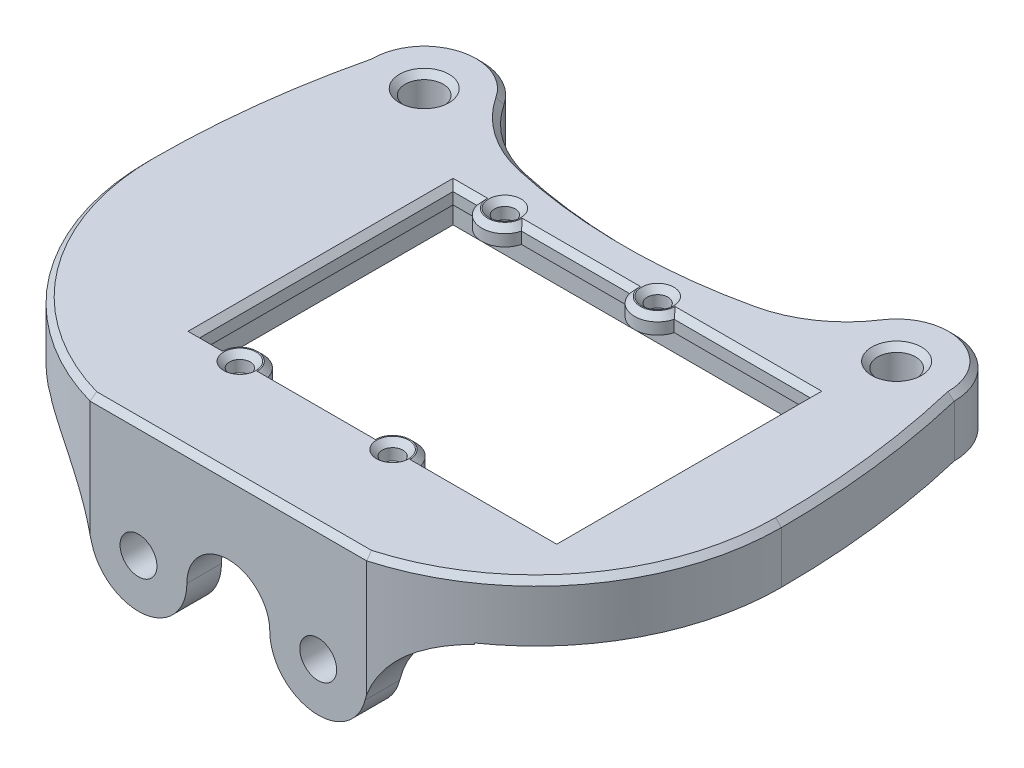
ISO-10303-21;
HEADER;
FILE_DESCRIPTION(('STEP AP214'),'2;1');
FILE_NAME('part.step','',(''),(''),'','','');
FILE_SCHEMA(('AUTOMOTIVE_DESIGN { 1 0 10303 214 1 1 1 1 }'));
ENDSEC;
DATA;
#1=APPLICATION_CONTEXT('core data for automotive mechanical design processes');
#2=APPLICATION_PROTOCOL_DEFINITION('international standard','automotive_design',2000,#1);
#3=PRODUCT_CONTEXT('',#1,'mechanical');
#4=PRODUCT('Part','Part','',(#3));
#5=PRODUCT_RELATED_PRODUCT_CATEGORY('part','',(#4));
#6=PRODUCT_DEFINITION_FORMATION('','',#4);
#7=PRODUCT_DEFINITION_CONTEXT('part definition',#1,'design');
#8=PRODUCT_DEFINITION('design','',#6,#7);
#9=PRODUCT_DEFINITION_SHAPE('','',#8);
#10=(LENGTH_UNIT() NAMED_UNIT(*) SI_UNIT(.MILLI.,.METRE.));
#11=(NAMED_UNIT(*) PLANE_ANGLE_UNIT() SI_UNIT($,.RADIAN.));
#12=(NAMED_UNIT(*) SI_UNIT($,.STERADIAN.) SOLID_ANGLE_UNIT());
#13=UNCERTAINTY_MEASURE_WITH_UNIT(LENGTH_MEASURE(1.E-05),#10,'distance_accuracy_value','');
#14=(GEOMETRIC_REPRESENTATION_CONTEXT(3) GLOBAL_UNCERTAINTY_ASSIGNED_CONTEXT((#13)) GLOBAL_UNIT_ASSIGNED_CONTEXT((#10,
#11,#12)) REPRESENTATION_CONTEXT('',''));
#15=CARTESIAN_POINT('',(0.,0.,0.));
#16=DIRECTION('',(0.,0.,1.));
#17=DIRECTION('',(1.,0.,0.));
#18=AXIS2_PLACEMENT_3D('',#15,#16,#17);
#19=CARTESIAN_POINT('',(0.,0.,0.));
#20=DIRECTION('',(0.,1.,0.));
#21=DIRECTION('',(0.,0.,1.));
#22=AXIS2_PLACEMENT_3D('',#19,#20,#21);
#23=PLANE('',#22);
#24=DIRECTION('',(0.,0.,1.));
#25=VECTOR('',#24,1.);
#26=CARTESIAN_POINT('',(-2.,0.,0.));
#27=LINE('',#26,#25);
#28=CARTESIAN_POINT('',(-2.,0.,-13.));
#29=VERTEX_POINT('',#28);
#30=CARTESIAN_POINT('',(-2.,0.,13.));
#31=VERTEX_POINT('',#30);
#32=EDGE_CURVE('E924',#29,#31,#27,.T.);
#33=ORIENTED_EDGE('',*,*,#32,.T.);
#34=DIRECTION('',(1.,0.,0.));
#35=VECTOR('',#34,1.);
#36=CARTESIAN_POINT('',(0.,0.,13.));
#37=LINE('',#36,#35);
#38=CARTESIAN_POINT('',(33.,0.,13.));
#39=VERTEX_POINT('',#38);
#40=EDGE_CURVE('E945',#31,#39,#37,.T.);
#41=ORIENTED_EDGE('',*,*,#40,.T.);
#42=DIRECTION('',(0.,0.,1.));
#43=VECTOR('',#42,1.);
#44=CARTESIAN_POINT('',(33.,0.,0.));
#45=LINE('',#44,#43);
#46=CARTESIAN_POINT('',(33.,0.,-13.));
#47=VERTEX_POINT('',#46);
#48=EDGE_CURVE('E949',#47,#39,#45,.T.);
#49=ORIENTED_EDGE('',*,*,#48,.F.);
#50=DIRECTION('',(1.,0.,0.));
#51=VECTOR('',#50,1.);
#52=CARTESIAN_POINT('',(0.,0.,-13.));
#53=LINE('',#52,#51);
#54=EDGE_CURVE('E930',#29,#47,#53,.T.);
#55=ORIENTED_EDGE('',*,*,#54,.F.);
#56=EDGE_LOOP('',(#33,#41,#49,#55));
#57=FACE_BOUND('',#56,.T.);
#58=CARTESIAN_POINT('',(-8.5,0.,-17.));
#59=DIRECTION('',(0.,1.,0.));
#60=DIRECTION('',(0.,0.,1.));
#61=AXIS2_PLACEMENT_3D('',#58,#59,#60);
#62=CIRCLE('',#61,1.65);
#63=CARTESIAN_POINT('',(-8.5,0.,-15.35));
#64=VERTEX_POINT('',#63);
#65=EDGE_CURVE('E1036',#64,#64,#62,.T.);
#66=ORIENTED_EDGE('',*,*,#65,.T.);
#67=EDGE_LOOP('',(#66));
#68=FACE_BOUND('',#67,.T.);
#69=CARTESIAN_POINT('',(32.5,0.,-17.));
#70=DIRECTION('',(0.,1.,0.));
#71=DIRECTION('',(0.,0.,1.));
#72=AXIS2_PLACEMENT_3D('',#69,#70,#71);
#73=CIRCLE('',#72,1.65);
#74=CARTESIAN_POINT('',(32.5,0.,-15.35));
#75=VERTEX_POINT('',#74);
#76=EDGE_CURVE('E1032',#75,#75,#73,.T.);
#77=ORIENTED_EDGE('',*,*,#76,.T.);
#78=EDGE_LOOP('',(#77));
#79=FACE_BOUND('',#78,.T.);
#80=DIRECTION('',(-1.,0.,0.));
#81=VECTOR('',#80,1.);
#82=CARTESIAN_POINT('',(24.,0.,17.5));
#83=LINE('',#82,#81);
#84=CARTESIAN_POINT('',(30.3473494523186,0.,17.5));
#85=VERTEX_POINT('',#84);
#86=CARTESIAN_POINT('',(-6.34734945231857,0.,17.5));
#87=VERTEX_POINT('',#86);
#88=EDGE_CURVE('E832',#85,#87,#83,.T.);
#89=ORIENTED_EDGE('',*,*,#88,.T.);
#90=CARTESIAN_POINT('',(5.80645161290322,0.,0.));
#91=DIRECTION('',(0.,1.,0.));
#92=DIRECTION('',(0.,0.,1.));
#93=AXIS2_PLACEMENT_3D('',#90,#91,#92);
#94=CIRCLE('',#93,21.3064516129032);
#95=CARTESIAN_POINT('',(-15.5,0.,0.));
#96=VERTEX_POINT('',#95);
#97=EDGE_CURVE('E1028',#96,#87,#94,.T.);
#98=ORIENTED_EDGE('',*,*,#97,.F.);
#99=CARTESIAN_POINT('',(57.7499999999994,0.,0.));
#100=DIRECTION('',(0.,1.,0.));
#101=DIRECTION('',(0.,0.,1.));
#102=AXIS2_PLACEMENT_3D('',#99,#100,#101);
#103=CIRCLE('',#102,73.2499999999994);
#104=CARTESIAN_POINT('',(-13.5,0.,-17.));
#105=VERTEX_POINT('',#104);
#106=EDGE_CURVE('E1025',#105,#96,#103,.T.);
#107=ORIENTED_EDGE('',*,*,#106,.F.);
#108=CARTESIAN_POINT('',(-8.5,0.,-17.));
#109=DIRECTION('',(0.,1.,0.));
#110=DIRECTION('',(0.,0.,1.));
#111=AXIS2_PLACEMENT_3D('',#108,#109,#110);
#112=CIRCLE('',#111,5.);
#113=CARTESIAN_POINT('',(-4.31409561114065,0.,-19.7346305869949));
#114=VERTEX_POINT('',#113);
#115=EDGE_CURVE('E1021',#105,#114,#112,.F.);
#116=ORIENTED_EDGE('',*,*,#115,.T.);
#117=CARTESIAN_POINT('',(4.05771316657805,0.,-25.2038917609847));
#118=DIRECTION('',(0.,1.,0.));
#119=DIRECTION('',(0.,0.,1.));
#120=AXIS2_PLACEMENT_3D('',#117,#118,#119);
#121=CIRCLE('',#120,10.);
#122=CARTESIAN_POINT('',(1.86302116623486,0.,-15.4476974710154));
#123=VERTEX_POINT('',#122);
#124=EDGE_CURVE('E1074',#114,#123,#121,.T.);
#125=ORIENTED_EDGE('',*,*,#124,.T.);
#126=CARTESIAN_POINT('',(12.,0.,-60.5102096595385));
#127=DIRECTION('',(0.,1.,0.));
#128=DIRECTION('',(0.,0.,1.));
#129=AXIS2_PLACEMENT_3D('',#126,#127,#128);
#130=CIRCLE('',#129,46.1886170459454);
#131=CARTESIAN_POINT('',(22.1369788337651,0.,-15.4476974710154));
#132=VERTEX_POINT('',#131);
#133=EDGE_CURVE('E1017',#123,#132,#130,.T.);
#134=ORIENTED_EDGE('',*,*,#133,.T.);
#135=CARTESIAN_POINT('',(19.9422868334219,0.,-25.2038917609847));
#136=DIRECTION('',(0.,1.,0.));
#137=DIRECTION('',(0.,0.,1.));
#138=AXIS2_PLACEMENT_3D('',#135,#136,#137);
#139=CIRCLE('',#138,10.);
#140=CARTESIAN_POINT('',(28.3140956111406,0.,-19.7346305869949));
#141=VERTEX_POINT('',#140);
#142=EDGE_CURVE('E1071',#132,#141,#139,.T.);
#143=ORIENTED_EDGE('',*,*,#142,.T.);
#144=CARTESIAN_POINT('',(32.5,0.,-17.));
#145=DIRECTION('',(0.,1.,0.));
#146=DIRECTION('',(0.,0.,1.));
#147=AXIS2_PLACEMENT_3D('',#144,#145,#146);
#148=CIRCLE('',#147,5.);
#149=CARTESIAN_POINT('',(37.5,0.,-17.));
#150=VERTEX_POINT('',#149);
#151=EDGE_CURVE('E1013',#141,#150,#148,.F.);
#152=ORIENTED_EDGE('',*,*,#151,.T.);
#153=CARTESIAN_POINT('',(-33.7500000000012,0.,1.75207071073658E-13));
#154=DIRECTION('',(0.,1.,0.));
#155=DIRECTION('',(0.,0.,1.));
#156=AXIS2_PLACEMENT_3D('',#153,#154,#155);
#157=CIRCLE('',#156,73.2500000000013);
#158=CARTESIAN_POINT('',(39.5,0.,0.));
#159=VERTEX_POINT('',#158);
#160=EDGE_CURVE('E1009',#150,#159,#157,.F.);
#161=ORIENTED_EDGE('',*,*,#160,.T.);
#162=CARTESIAN_POINT('',(18.1935483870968,0.,0.));
#163=DIRECTION('',(0.,1.,0.));
#164=DIRECTION('',(0.,0.,1.));
#165=AXIS2_PLACEMENT_3D('',#162,#163,#164);
#166=CIRCLE('',#165,21.3064516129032);
#167=EDGE_CURVE('E1005',#159,#85,#166,.F.);
#168=ORIENTED_EDGE('',*,*,#167,.T.);
#169=EDGE_LOOP('',(#89,#98,#107,#116,#125,#134,#143,#152,#161,#168));
#170=FACE_BOUND('',#169,.T.);
#171=ADVANCED_FACE('F534',(#57,#68,#79,#170),#23,.F.);
#172=CARTESIAN_POINT('',(0.,5.,0.));
#173=DIRECTION('',(0.,1.,0.));
#174=DIRECTION('',(0.,0.,1.));
#175=AXIS2_PLACEMENT_3D('',#172,#173,#174);
#176=PLANE('',#175);
#177=CARTESIAN_POINT('',(4.,5.,11.5));
#178=DIRECTION('',(0.,1.,0.));
#179=DIRECTION('',(0.,0.,1.));
#180=AXIS2_PLACEMENT_3D('',#177,#178,#179);
#181=CIRCLE('',#180,1.40000000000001);
#182=CARTESIAN_POINT('',(4.,5.,12.9));
#183=VERTEX_POINT('',#182);
#184=EDGE_CURVE('E1169',#183,#183,#181,.F.);
#185=ORIENTED_EDGE('',*,*,#184,.T.);
#186=EDGE_LOOP('',(#185));
#187=FACE_BOUND('',#186,.T.);
#188=CARTESIAN_POINT('',(17.26,5.,-11.5));
#189=DIRECTION('',(0.,1.,0.));
#190=DIRECTION('',(0.,0.,1.));
#191=AXIS2_PLACEMENT_3D('',#188,#189,#190);
#192=CIRCLE('',#191,1.40000000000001);
#193=CARTESIAN_POINT('',(17.26,5.,-10.1));
#194=VERTEX_POINT('',#193);
#195=EDGE_CURVE('E1165',#194,#194,#192,.F.);
#196=ORIENTED_EDGE('',*,*,#195,.T.);
#197=EDGE_LOOP('',(#196));
#198=FACE_BOUND('',#197,.T.);
#199=CARTESIAN_POINT('',(17.26,5.,11.5));
#200=DIRECTION('',(0.,1.,0.));
#201=DIRECTION('',(0.,0.,1.));
#202=AXIS2_PLACEMENT_3D('',#199,#200,#201);
#203=CIRCLE('',#202,1.50000000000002);
#204=CARTESIAN_POINT('',(18.76,5.,11.5));
#205=VERTEX_POINT('',#204);
#206=CARTESIAN_POINT('',(15.76,5.,11.5));
#207=VERTEX_POINT('',#206);
#208=EDGE_CURVE('E1158',#205,#207,#203,.T.);
#209=ORIENTED_EDGE('',*,*,#208,.T.);
#210=DIRECTION('',(-1.,0.,0.));
#211=VECTOR('',#210,1.);
#212=CARTESIAN_POINT('',(5.93649167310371,5.,11.5));
#213=LINE('',#212,#211);
#214=CARTESIAN_POINT('',(5.50000000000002,5.,11.5));
#215=VERTEX_POINT('',#214);
#216=EDGE_CURVE('E1161',#207,#215,#213,.T.);
#217=ORIENTED_EDGE('',*,*,#216,.T.);
#218=CARTESIAN_POINT('',(4.,5.,11.5));
#219=DIRECTION('',(0.,1.,0.));
#220=DIRECTION('',(0.,0.,1.));
#221=AXIS2_PLACEMENT_3D('',#218,#219,#220);
#222=CIRCLE('',#221,1.50000000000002);
#223=CARTESIAN_POINT('',(2.49999999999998,5.,11.5));
#224=VERTEX_POINT('',#223);
#225=EDGE_CURVE('E1128',#215,#224,#222,.T.);
#226=ORIENTED_EDGE('',*,*,#225,.T.);
#227=DIRECTION('',(-1.,0.,0.));
#228=VECTOR('',#227,1.);
#229=CARTESIAN_POINT('',(0.,5.,11.5));
#230=LINE('',#229,#228);
#231=CARTESIAN_POINT('',(-0.499999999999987,5.,11.5));
#232=VERTEX_POINT('',#231);
#233=EDGE_CURVE('E1131',#224,#232,#230,.T.);
#234=ORIENTED_EDGE('',*,*,#233,.T.);
#235=DIRECTION('',(0.,0.,-1.));
#236=VECTOR('',#235,1.);
#237=CARTESIAN_POINT('',(-0.499999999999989,5.,0.));
#238=LINE('',#237,#236);
#239=CARTESIAN_POINT('',(-0.49999999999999,5.,-11.5));
#240=VERTEX_POINT('',#239);
#241=EDGE_CURVE('E1134',#232,#240,#238,.T.);
#242=ORIENTED_EDGE('',*,*,#241,.T.);
#243=DIRECTION('',(1.,0.,0.));
#244=VECTOR('',#243,1.);
#245=CARTESIAN_POINT('',(0.,5.,-11.5));
#246=LINE('',#245,#244);
#247=CARTESIAN_POINT('',(2.49999999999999,5.,-11.5));
#248=VERTEX_POINT('',#247);
#249=EDGE_CURVE('E1137',#240,#248,#246,.T.);
#250=ORIENTED_EDGE('',*,*,#249,.T.);
#251=CARTESIAN_POINT('',(4.,5.,-11.5));
#252=DIRECTION('',(0.,1.,0.));
#253=DIRECTION('',(0.,0.,1.));
#254=AXIS2_PLACEMENT_3D('',#251,#252,#253);
#255=CIRCLE('',#254,1.50000000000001);
#256=CARTESIAN_POINT('',(5.50000000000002,5.,-11.5));
#257=VERTEX_POINT('',#256);
#258=EDGE_CURVE('E1140',#248,#257,#255,.T.);
#259=ORIENTED_EDGE('',*,*,#258,.T.);
#260=DIRECTION('',(1.,0.,0.));
#261=VECTOR('',#260,1.);
#262=CARTESIAN_POINT('',(0.,5.,-11.5));
#263=LINE('',#262,#261);
#264=CARTESIAN_POINT('',(15.76,5.,-11.5));
#265=VERTEX_POINT('',#264);
#266=EDGE_CURVE('E1143',#257,#265,#263,.T.);
#267=ORIENTED_EDGE('',*,*,#266,.T.);
#268=CARTESIAN_POINT('',(17.26,5.,-11.5));
#269=DIRECTION('',(0.,1.,0.));
#270=DIRECTION('',(0.,0.,1.));
#271=AXIS2_PLACEMENT_3D('',#268,#269,#270);
#272=CIRCLE('',#271,1.50000000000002);
#273=CARTESIAN_POINT('',(18.76,5.,-11.5));
#274=VERTEX_POINT('',#273);
#275=EDGE_CURVE('E1146',#265,#274,#272,.T.);
#276=ORIENTED_EDGE('',*,*,#275,.T.);
#277=DIRECTION('',(1.,0.,0.));
#278=VECTOR('',#277,1.);
#279=CARTESIAN_POINT('',(0.,5.,-11.5));
#280=LINE('',#279,#278);
#281=CARTESIAN_POINT('',(31.5,5.,-11.5));
#282=VERTEX_POINT('',#281);
#283=EDGE_CURVE('E1149',#274,#282,#280,.T.);
#284=ORIENTED_EDGE('',*,*,#283,.T.);
#285=DIRECTION('',(0.,0.,1.));
#286=VECTOR('',#285,1.);
#287=CARTESIAN_POINT('',(31.5,5.,11.));
#288=LINE('',#287,#286);
#289=CARTESIAN_POINT('',(31.5,5.,11.5));
#290=VERTEX_POINT('',#289);
#291=EDGE_CURVE('E1152',#282,#290,#288,.T.);
#292=ORIENTED_EDGE('',*,*,#291,.T.);
#293=DIRECTION('',(-1.,0.,0.));
#294=VECTOR('',#293,1.);
#295=CARTESIAN_POINT('',(19.1964916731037,5.,11.5));
#296=LINE('',#295,#294);
#297=EDGE_CURVE('E1155',#290,#205,#296,.T.);
#298=ORIENTED_EDGE('',*,*,#297,.T.);
#299=EDGE_LOOP('',(#209,#217,#226,#234,#242,#250,#259,#267,#276,#284,#292,#298));
#300=FACE_BOUND('',#299,.T.);
#301=CARTESIAN_POINT('',(5.80645161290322,5.,0.));
#302=DIRECTION('',(0.,1.,0.));
#303=DIRECTION('',(0.,0.,1.));
#304=AXIS2_PLACEMENT_3D('',#301,#302,#303);
#305=CIRCLE('',#304,20.8064516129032);
#306=CARTESIAN_POINT('',(-15.,5.,0.));
#307=VERTEX_POINT('',#306);
#308=CARTESIAN_POINT('',(0.0698647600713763,5.,20.));
#309=VERTEX_POINT('',#308);
#310=EDGE_CURVE('E1121',#307,#309,#305,.T.);
#311=ORIENTED_EDGE('',*,*,#310,.T.);
#312=DIRECTION('',(1.,0.,0.));
#313=VECTOR('',#312,1.);
#314=CARTESIAN_POINT('',(24.,5.,20.));
#315=LINE('',#314,#313);
#316=CARTESIAN_POINT('',(23.9301352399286,5.,20.));
#317=VERTEX_POINT('',#316);
#318=EDGE_CURVE('E1124',#309,#317,#315,.T.);
#319=ORIENTED_EDGE('',*,*,#318,.T.);
#320=CARTESIAN_POINT('',(18.1935483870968,5.,0.));
#321=DIRECTION('',(0.,1.,0.));
#322=DIRECTION('',(0.,0.,1.));
#323=AXIS2_PLACEMENT_3D('',#320,#321,#322);
#324=CIRCLE('',#323,20.8064516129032);
#325=CARTESIAN_POINT('',(39.,5.,0.));
#326=VERTEX_POINT('',#325);
#327=EDGE_CURVE('E1097',#317,#326,#324,.T.);
#328=ORIENTED_EDGE('',*,*,#327,.T.);
#329=CARTESIAN_POINT('',(-33.7500000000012,5.,1.75207071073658E-13));
#330=DIRECTION('',(0.,1.,0.));
#331=DIRECTION('',(0.,0.,1.));
#332=AXIS2_PLACEMENT_3D('',#329,#330,#331);
#333=CIRCLE('',#332,72.7500000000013);
#334=CARTESIAN_POINT('',(36.9996339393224,5.,-16.9426030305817));
#335=VERTEX_POINT('',#334);
#336=EDGE_CURVE('E1100',#326,#335,#333,.T.);
#337=ORIENTED_EDGE('',*,*,#336,.T.);
#338=CARTESIAN_POINT('',(32.5,5.,-17.));
#339=DIRECTION('',(0.,1.,0.));
#340=DIRECTION('',(0.,0.,1.));
#341=AXIS2_PLACEMENT_3D('',#338,#339,#340);
#342=CIRCLE('',#341,4.50000000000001);
#343=CARTESIAN_POINT('',(28.7326860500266,5.,-19.4611675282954));
#344=VERTEX_POINT('',#343);
#345=EDGE_CURVE('E1103',#335,#344,#342,.T.);
#346=ORIENTED_EDGE('',*,*,#345,.T.);
#347=CARTESIAN_POINT('',(19.9422868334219,5.,-25.2038917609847));
#348=DIRECTION('',(0.,1.,0.));
#349=DIRECTION('',(0.,0.,1.));
#350=AXIS2_PLACEMENT_3D('',#347,#348,#349);
#351=CIRCLE('',#350,10.5);
#352=CARTESIAN_POINT('',(22.2467134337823,5.,-14.9598877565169));
#353=VERTEX_POINT('',#352);
#354=EDGE_CURVE('E1106',#344,#353,#351,.F.);
#355=ORIENTED_EDGE('',*,*,#354,.T.);
#356=CARTESIAN_POINT('',(12.,5.,-60.5102096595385));
#357=DIRECTION('',(0.,1.,0.));
#358=DIRECTION('',(0.,0.,1.));
#359=AXIS2_PLACEMENT_3D('',#356,#357,#358);
#360=CIRCLE('',#359,46.6886170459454);
#361=CARTESIAN_POINT('',(1.7532865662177,5.,-14.9598877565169));
#362=VERTEX_POINT('',#361);
#363=EDGE_CURVE('E1109',#353,#362,#360,.F.);
#364=ORIENTED_EDGE('',*,*,#363,.T.);
#365=CARTESIAN_POINT('',(4.05771316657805,5.,-25.2038917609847));
#366=DIRECTION('',(0.,1.,0.));
#367=DIRECTION('',(0.,0.,1.));
#368=AXIS2_PLACEMENT_3D('',#365,#366,#367);
#369=CIRCLE('',#368,10.5);
#370=CARTESIAN_POINT('',(-4.73268605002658,5.,-19.4611675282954));
#371=VERTEX_POINT('',#370);
#372=EDGE_CURVE('E1112',#362,#371,#369,.F.);
#373=ORIENTED_EDGE('',*,*,#372,.T.);
#374=CARTESIAN_POINT('',(-8.5,5.,-17.));
#375=DIRECTION('',(0.,1.,0.));
#376=DIRECTION('',(0.,0.,1.));
#377=AXIS2_PLACEMENT_3D('',#374,#375,#376);
#378=CIRCLE('',#377,4.50000000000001);
#379=CARTESIAN_POINT('',(-12.9996339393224,5.,-16.9426030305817));
#380=VERTEX_POINT('',#379);
#381=EDGE_CURVE('E1115',#371,#380,#378,.T.);
#382=ORIENTED_EDGE('',*,*,#381,.T.);
#383=CARTESIAN_POINT('',(57.7499999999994,5.,0.));
#384=DIRECTION('',(0.,1.,0.));
#385=DIRECTION('',(0.,0.,1.));
#386=AXIS2_PLACEMENT_3D('',#383,#384,#385);
#387=CIRCLE('',#386,72.7499999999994);
#388=EDGE_CURVE('E1118',#380,#307,#387,.T.);
#389=ORIENTED_EDGE('',*,*,#388,.T.);
#390=EDGE_LOOP('',(#311,#319,#328,#337,#346,#355,#364,#373,#382,#389));
#391=FACE_BOUND('',#390,.T.);
#392=CARTESIAN_POINT('',(32.5,5.,-17.));
#393=DIRECTION('',(0.,1.,0.));
#394=DIRECTION('',(0.,0.,1.));
#395=AXIS2_PLACEMENT_3D('',#392,#393,#394);
#396=CIRCLE('',#395,2.14999999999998);
#397=CARTESIAN_POINT('',(32.5,5.,-14.85));
#398=VERTEX_POINT('',#397);
#399=EDGE_CURVE('E1093',#398,#398,#396,.F.);
#400=ORIENTED_EDGE('',*,*,#399,.T.);
#401=EDGE_LOOP('',(#400));
#402=FACE_BOUND('',#401,.T.);
#403=CARTESIAN_POINT('',(-8.5,5.,-17.));
#404=DIRECTION('',(0.,1.,0.));
#405=DIRECTION('',(0.,0.,1.));
#406=AXIS2_PLACEMENT_3D('',#403,#404,#405);
#407=CIRCLE('',#406,2.15000000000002);
#408=CARTESIAN_POINT('',(-8.5,5.,-14.85));
#409=VERTEX_POINT('',#408);
#410=EDGE_CURVE('E1089',#409,#409,#407,.F.);
#411=ORIENTED_EDGE('',*,*,#410,.T.);
#412=EDGE_LOOP('',(#411));
#413=FACE_BOUND('',#412,.T.);
#414=CARTESIAN_POINT('',(4.,5.,-11.5));
#415=DIRECTION('',(0.,1.,0.));
#416=DIRECTION('',(0.,0.,1.));
#417=AXIS2_PLACEMENT_3D('',#414,#415,#416);
#418=CIRCLE('',#417,1.40000000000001);
#419=CARTESIAN_POINT('',(4.,5.,-10.1));
#420=VERTEX_POINT('',#419);
#421=EDGE_CURVE('E1085',#420,#420,#418,.F.);
#422=ORIENTED_EDGE('',*,*,#421,.T.);
#423=EDGE_LOOP('',(#422));
#424=FACE_BOUND('',#423,.T.);
#425=CARTESIAN_POINT('',(17.26,5.,11.5));
#426=DIRECTION('',(0.,1.,0.));
#427=DIRECTION('',(0.,0.,1.));
#428=AXIS2_PLACEMENT_3D('',#425,#426,#427);
#429=CIRCLE('',#428,1.40000000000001);
#430=CARTESIAN_POINT('',(17.26,5.,12.9));
#431=VERTEX_POINT('',#430);
#432=EDGE_CURVE('E1081',#431,#431,#429,.F.);
#433=ORIENTED_EDGE('',*,*,#432,.T.);
#434=EDGE_LOOP('',(#433));
#435=FACE_BOUND('',#434,.T.);
#436=ADVANCED_FACE('F1637',(#187,#198,#300,#391,#402,#413,#424,#435),#176,.T.);
#437=CARTESIAN_POINT('',(-8.5,5.,-17.));
#438=DIRECTION('',(0.,-1.,0.));
#439=DIRECTION('',(0.,0.,-1.));
#440=AXIS2_PLACEMENT_3D('',#437,#438,#439);
#441=CYLINDRICAL_SURFACE('',#440,1.65);
#442=CARTESIAN_POINT('',(-8.5,4.49999999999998,-17.));
#443=DIRECTION('',(0.,1.,0.));
#444=DIRECTION('',(0.,0.,1.));
#445=AXIS2_PLACEMENT_3D('',#442,#443,#444);
#446=CIRCLE('',#445,1.65);
#447=CARTESIAN_POINT('',(-8.5,4.49999999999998,-15.35));
#448=VERTEX_POINT('',#447);
#449=EDGE_CURVE('E1249',#448,#448,#446,.T.);
#450=ORIENTED_EDGE('',*,*,#449,.T.);
#451=EDGE_LOOP('',(#450));
#452=FACE_BOUND('',#451,.T.);
#453=ORIENTED_EDGE('',*,*,#65,.F.);
#454=EDGE_LOOP('',(#453));
#455=FACE_BOUND('',#454,.T.);
#456=ADVANCED_FACE('F1697',(#452,#455),#441,.F.);
#457=CARTESIAN_POINT('',(32.5,5.,-17.));
#458=DIRECTION('',(0.,-1.,0.));
#459=DIRECTION('',(0.,0.,-1.));
#460=AXIS2_PLACEMENT_3D('',#457,#458,#459);
#461=CYLINDRICAL_SURFACE('',#460,1.65);
#462=CARTESIAN_POINT('',(32.5,4.50000000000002,-17.));
#463=DIRECTION('',(0.,1.,0.));
#464=DIRECTION('',(0.,0.,1.));
#465=AXIS2_PLACEMENT_3D('',#462,#463,#464);
#466=CIRCLE('',#465,1.65);
#467=CARTESIAN_POINT('',(32.5,4.50000000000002,-15.35));
#468=VERTEX_POINT('',#467);
#469=EDGE_CURVE('E1245',#468,#468,#466,.T.);
#470=ORIENTED_EDGE('',*,*,#469,.T.);
#471=EDGE_LOOP('',(#470));
#472=FACE_BOUND('',#471,.T.);
#473=ORIENTED_EDGE('',*,*,#76,.F.);
#474=EDGE_LOOP('',(#473));
#475=FACE_BOUND('',#474,.T.);
#476=ADVANCED_FACE('F1569',(#472,#475),#461,.F.);
#477=CARTESIAN_POINT('',(-33.7500000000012,5.,1.75207071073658E-13));
#478=DIRECTION('',(0.,-1.,0.));
#479=DIRECTION('',(0.,0.,-1.));
#480=AXIS2_PLACEMENT_3D('',#477,#478,#479);
#481=CYLINDRICAL_SURFACE('',#480,73.2500000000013);
#482=DIRECTION('',(0.,-1.,0.));
#483=VECTOR('',#482,1.);
#484=CARTESIAN_POINT('',(37.5,5.,-17.));
#485=LINE('',#484,#483);
#486=CARTESIAN_POINT('',(37.5,4.50000000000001,-17.));
#487=VERTEX_POINT('',#486);
#488=EDGE_CURVE('E1051',#487,#150,#485,.T.);
#489=ORIENTED_EDGE('',*,*,#488,.F.);
#490=CARTESIAN_POINT('',(-33.7500000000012,4.50000000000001,1.75207071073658E-13));
#491=DIRECTION('',(0.,1.,0.));
#492=DIRECTION('',(0.,0.,1.));
#493=AXIS2_PLACEMENT_3D('',#490,#491,#492);
#494=CIRCLE('',#493,73.2500000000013);
#495=CARTESIAN_POINT('',(39.5,4.50000000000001,0.));
#496=VERTEX_POINT('',#495);
#497=EDGE_CURVE('E1239',#487,#496,#494,.F.);
#498=ORIENTED_EDGE('',*,*,#497,.T.);
#499=DIRECTION('',(0.,-1.,0.));
#500=VECTOR('',#499,1.);
#501=CARTESIAN_POINT('',(39.5,5.,0.));
#502=LINE('',#501,#500);
#503=EDGE_CURVE('E1054',#496,#159,#502,.T.);
#504=ORIENTED_EDGE('',*,*,#503,.T.);
#505=ORIENTED_EDGE('',*,*,#160,.F.);
#506=EDGE_LOOP('',(#489,#498,#504,#505));
#507=FACE_BOUND('',#506,.T.);
#508=ADVANCED_FACE('F1565',(#507),#481,.T.);
#509=CARTESIAN_POINT('',(32.5,5.,-17.));
#510=DIRECTION('',(0.,-1.,0.));
#511=DIRECTION('',(0.,0.,-1.));
#512=AXIS2_PLACEMENT_3D('',#509,#510,#511);
#513=CYLINDRICAL_SURFACE('',#512,5.);
#514=DIRECTION('',(0.,-1.,0.));
#515=VECTOR('',#514,1.);
#516=CARTESIAN_POINT('',(28.3140956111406,5.,-19.7346305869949));
#517=LINE('',#516,#515);
#518=CARTESIAN_POINT('',(28.3140956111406,4.50000000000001,-19.7346305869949));
#519=VERTEX_POINT('',#518);
#520=EDGE_CURVE('E1064',#141,#519,#517,.F.);
#521=ORIENTED_EDGE('',*,*,#520,.T.);
#522=CARTESIAN_POINT('',(32.5,4.50000000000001,-17.));
#523=DIRECTION('',(0.,1.,0.));
#524=DIRECTION('',(0.,0.,1.));
#525=AXIS2_PLACEMENT_3D('',#522,#523,#524);
#526=CIRCLE('',#525,5.);
#527=EDGE_CURVE('E1236',#519,#487,#526,.F.);
#528=ORIENTED_EDGE('',*,*,#527,.T.);
#529=ORIENTED_EDGE('',*,*,#488,.T.);
#530=ORIENTED_EDGE('',*,*,#151,.F.);
#531=EDGE_LOOP('',(#521,#528,#529,#530));
#532=FACE_BOUND('',#531,.T.);
#533=ADVANCED_FACE('F1561',(#532),#513,.T.);
#534=CARTESIAN_POINT('',(12.,5.,-60.5102096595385));
#535=DIRECTION('',(0.,-1.,0.));
#536=DIRECTION('',(0.,0.,-1.));
#537=AXIS2_PLACEMENT_3D('',#534,#535,#536);
#538=CYLINDRICAL_SURFACE('',#537,46.1886170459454);
#539=DIRECTION('',(0.,-1.,0.));
#540=VECTOR('',#539,1.);
#541=CARTESIAN_POINT('',(1.86302116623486,5.,-15.4476974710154));
#542=LINE('',#541,#540);
#543=CARTESIAN_POINT('',(1.86302116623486,4.50000000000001,-15.4476974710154));
#544=VERTEX_POINT('',#543);
#545=EDGE_CURVE('E1057',#123,#544,#542,.F.);
#546=ORIENTED_EDGE('',*,*,#545,.T.);
#547=CARTESIAN_POINT('',(12.,4.50000000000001,-60.5102096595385));
#548=DIRECTION('',(0.,1.,0.));
#549=DIRECTION('',(0.,0.,1.));
#550=AXIS2_PLACEMENT_3D('',#547,#548,#549);
#551=CIRCLE('',#550,46.1886170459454);
#552=CARTESIAN_POINT('',(22.1369788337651,4.50000000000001,-15.4476974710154));
#553=VERTEX_POINT('',#552);
#554=EDGE_CURVE('E1230',#544,#553,#551,.T.);
#555=ORIENTED_EDGE('',*,*,#554,.T.);
#556=DIRECTION('',(0.,-1.,0.));
#557=VECTOR('',#556,1.);
#558=CARTESIAN_POINT('',(22.1369788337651,5.,-15.4476974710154));
#559=LINE('',#558,#557);
#560=EDGE_CURVE('E1061',#553,#132,#559,.T.);
#561=ORIENTED_EDGE('',*,*,#560,.T.);
#562=ORIENTED_EDGE('',*,*,#133,.F.);
#563=EDGE_LOOP('',(#546,#555,#561,#562));
#564=FACE_BOUND('',#563,.T.);
#565=ADVANCED_FACE('F1557',(#564),#538,.F.);
#566=CARTESIAN_POINT('',(-8.5,5.,-17.));
#567=DIRECTION('',(0.,-1.,0.));
#568=DIRECTION('',(0.,0.,-1.));
#569=AXIS2_PLACEMENT_3D('',#566,#567,#568);
#570=CYLINDRICAL_SURFACE('',#569,5.);
#571=DIRECTION('',(0.,-1.,0.));
#572=VECTOR('',#571,1.);
#573=CARTESIAN_POINT('',(-13.5,5.,-17.));
#574=LINE('',#573,#572);
#575=CARTESIAN_POINT('',(-13.5,4.50000000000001,-17.));
#576=VERTEX_POINT('',#575);
#577=EDGE_CURVE('E1048',#576,#105,#574,.T.);
#578=ORIENTED_EDGE('',*,*,#577,.F.);
#579=CARTESIAN_POINT('',(-8.5,4.50000000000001,-17.));
#580=DIRECTION('',(0.,1.,0.));
#581=DIRECTION('',(0.,0.,1.));
#582=AXIS2_PLACEMENT_3D('',#579,#580,#581);
#583=CIRCLE('',#582,5.);
#584=CARTESIAN_POINT('',(-4.31409561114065,4.50000000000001,-19.7346305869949));
#585=VERTEX_POINT('',#584);
#586=EDGE_CURVE('E1224',#576,#585,#583,.F.);
#587=ORIENTED_EDGE('',*,*,#586,.T.);
#588=DIRECTION('',(0.,-1.,0.));
#589=VECTOR('',#588,1.);
#590=CARTESIAN_POINT('',(-4.31409561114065,5.,-19.7346305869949));
#591=LINE('',#590,#589);
#592=EDGE_CURVE('E1068',#585,#114,#591,.T.);
#593=ORIENTED_EDGE('',*,*,#592,.T.);
#594=ORIENTED_EDGE('',*,*,#115,.F.);
#595=EDGE_LOOP('',(#578,#587,#593,#594));
#596=FACE_BOUND('',#595,.T.);
#597=ADVANCED_FACE('F1553',(#596),#570,.T.);
#598=CARTESIAN_POINT('',(57.7499999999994,5.,0.));
#599=DIRECTION('',(0.,-1.,0.));
#600=DIRECTION('',(0.,0.,-1.));
#601=AXIS2_PLACEMENT_3D('',#598,#599,#600);
#602=CYLINDRICAL_SURFACE('',#601,73.2499999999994);
#603=DIRECTION('',(0.,-1.,0.));
#604=VECTOR('',#603,1.);
#605=CARTESIAN_POINT('',(-15.5,5.,0.));
#606=LINE('',#605,#604);
#607=CARTESIAN_POINT('',(-15.5,4.50000000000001,0.));
#608=VERTEX_POINT('',#607);
#609=EDGE_CURVE('E1045',#608,#96,#606,.T.);
#610=ORIENTED_EDGE('',*,*,#609,.F.);
#611=CARTESIAN_POINT('',(57.7499999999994,4.50000000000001,0.));
#612=DIRECTION('',(0.,1.,0.));
#613=DIRECTION('',(0.,0.,1.));
#614=AXIS2_PLACEMENT_3D('',#611,#612,#613);
#615=CIRCLE('',#614,73.2499999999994);
#616=EDGE_CURVE('E1221',#608,#576,#615,.F.);
#617=ORIENTED_EDGE('',*,*,#616,.T.);
#618=ORIENTED_EDGE('',*,*,#577,.T.);
#619=ORIENTED_EDGE('',*,*,#106,.T.);
#620=EDGE_LOOP('',(#610,#617,#618,#619));
#621=FACE_BOUND('',#620,.T.);
#622=ADVANCED_FACE('F1548',(#621),#602,.T.);
#623=CARTESIAN_POINT('',(5.80645161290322,5.,0.));
#624=DIRECTION('',(0.,-1.,0.));
#625=DIRECTION('',(0.,0.,-1.));
#626=AXIS2_PLACEMENT_3D('',#623,#624,#625);
#627=CYLINDRICAL_SURFACE('',#626,21.3064516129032);
#628=DIRECTION('',(0.,-1.,0.));
#629=VECTOR('',#628,1.);
#630=CARTESIAN_POINT('',(0.,5.,20.5));
#631=LINE('',#630,#629);
#632=CARTESIAN_POINT('',(0.,4.50000000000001,20.5));
#633=VERTEX_POINT('',#632);
#634=CARTESIAN_POINT('',(0.,-5.58076057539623,20.5));
#635=VERTEX_POINT('',#634);
#636=EDGE_CURVE('E1042',#633,#635,#631,.T.);
#637=ORIENTED_EDGE('',*,*,#636,.F.);
#638=CARTESIAN_POINT('',(5.80645161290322,4.50000000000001,0.));
#639=DIRECTION('',(0.,1.,0.));
#640=DIRECTION('',(0.,0.,1.));
#641=AXIS2_PLACEMENT_3D('',#638,#639,#640);
#642=CIRCLE('',#641,21.3064516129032);
#643=EDGE_CURVE('E1218',#633,#608,#642,.F.);
#644=ORIENTED_EDGE('',*,*,#643,.T.);
#645=ORIENTED_EDGE('',*,*,#609,.T.);
#646=ORIENTED_EDGE('',*,*,#97,.T.);
#647=DIRECTION('',(0.,-1.,0.));
#648=VECTOR('',#647,1.);
#649=CARTESIAN_POINT('',(-6.34734945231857,0.,17.5));
#650=LINE('',#649,#648);
#651=CARTESIAN_POINT('',(-6.34734945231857,-0.102754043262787,17.5));
#652=VERTEX_POINT('',#651);
#653=EDGE_CURVE('E544',#87,#652,#650,.T.);
#654=ORIENTED_EDGE('',*,*,#653,.T.);
#655=CARTESIAN_POINT('',(-6.34734945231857,-0.102754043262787,17.5));
#656=CARTESIAN_POINT('',(-6.14933836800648,-0.134779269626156,17.6375625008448));
#657=CARTESIAN_POINT('',(-5.94975697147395,-0.174743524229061,17.7711476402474));
#658=CARTESIAN_POINT('',(-5.54889420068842,-0.271452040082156,18.0299078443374));
#659=CARTESIAN_POINT('',(-5.34761116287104,-0.328215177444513,18.1550732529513));
#660=CARTESIAN_POINT('',(-4.94557664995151,-0.459245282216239,18.3960238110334));
#661=CARTESIAN_POINT('',(-4.74482484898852,-0.533482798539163,18.5118243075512));
#662=CARTESIAN_POINT('',(-4.34564180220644,-0.700021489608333,18.7337122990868));
#663=CARTESIAN_POINT('',(-4.14720911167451,-0.792310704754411,18.8398061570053));
#664=CARTESIAN_POINT('',(-3.72546763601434,-1.01039043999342,19.057063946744));
#665=CARTESIAN_POINT('',(-3.502847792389,-1.1391219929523,19.1666356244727));
#666=CARTESIAN_POINT('',(-3.06688009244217,-1.42072464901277,19.3723244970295));
#667=CARTESIAN_POINT('',(-2.85353012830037,-1.5735902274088,19.4684447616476));
#668=CARTESIAN_POINT('',(-2.48577479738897,-1.86598519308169,19.6273945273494));
#669=CARTESIAN_POINT('',(-2.32882428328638,-2.00090213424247,19.6928705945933));
#670=CARTESIAN_POINT('',(-2.0242215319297,-2.28426256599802,19.8159637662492));
#671=CARTESIAN_POINT('',(-1.8765717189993,-2.43270955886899,19.8735788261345));
#672=CARTESIAN_POINT('',(-1.59199152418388,-2.74244953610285,19.9812689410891));
#673=CARTESIAN_POINT('',(-1.45507476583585,-2.90375833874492,20.0313344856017));
#674=CARTESIAN_POINT('',(-1.19358105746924,-3.23804069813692,20.1242062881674));
#675=CARTESIAN_POINT('',(-1.06900328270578,-3.4110134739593,20.1670130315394));
#676=CARTESIAN_POINT('',(-0.850217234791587,-3.74206808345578,20.2401825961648));
#677=CARTESIAN_POINT('',(-0.754209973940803,-3.89876645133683,20.2714493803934));
#678=CARTESIAN_POINT('',(-0.572891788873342,-4.21906386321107,20.3292377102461));
#679=CARTESIAN_POINT('',(-0.487579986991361,-4.38266233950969,20.3557596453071));
#680=CARTESIAN_POINT('',(-0.328332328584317,-4.71574982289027,20.404319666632));
#681=CARTESIAN_POINT('',(-0.254385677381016,-4.88523305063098,20.4263620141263));
#682=CARTESIAN_POINT('',(-0.118249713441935,-5.22935699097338,20.4662581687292));
#683=CARTESIAN_POINT('',(-0.0560616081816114,-5.40399823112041,20.484111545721));
#684=CARTESIAN_POINT('',(0.,-5.58076057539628,20.5));
#685=B_SPLINE_CURVE_WITH_KNOTS('',3,(#655,#656,#657,#658,#659,#660,#661,#662,#663,#664,#665,
#666,#667,#668,#669,#670,#671,#672,#673,#674,#675,#676,#677,#678,#679,#680,#681,#682,#683,#684),
.UNSPECIFIED.,.F.,.F.,(4,2,2,2,2,2,2,2,2,2,2,2,2,2,4),(0.,0.729614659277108,1.46005228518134,
2.18926754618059,2.91800131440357,3.7551049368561,4.5920172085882,5.24253378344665,
5.89321922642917,6.54471764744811,7.19617249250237,7.7549277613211,8.31363714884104,
8.87181254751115,9.43004523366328),.UNSPECIFIED.);
#686=EDGE_CURVE('E1528',#652,#635,#685,.T.);
#687=ORIENTED_EDGE('',*,*,#686,.T.);
#688=EDGE_LOOP('',(#637,#644,#645,#646,#654,#687));
#689=FACE_BOUND('',#688,.T.);
#690=ADVANCED_FACE('F1542',(#689),#627,.T.);
#691=CARTESIAN_POINT('',(0.,5.,20.5));
#692=DIRECTION('',(0.,0.,-1.));
#693=DIRECTION('',(-1.,0.,0.));
#694=AXIS2_PLACEMENT_3D('',#691,#692,#693);
#695=PLANE('',#694);
#696=DIRECTION('',(0.,-1.,0.));
#697=VECTOR('',#696,1.);
#698=CARTESIAN_POINT('',(24.,5.,20.5));
#699=LINE('',#698,#697);
#700=CARTESIAN_POINT('',(24.,4.50000000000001,20.5));
#701=VERTEX_POINT('',#700);
#702=CARTESIAN_POINT('',(24.,-5.5807605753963,20.5));
#703=VERTEX_POINT('',#702);
#704=EDGE_CURVE('E555',#701,#703,#699,.T.);
#705=ORIENTED_EDGE('',*,*,#704,.F.);
#706=DIRECTION('',(-1.,0.,0.));
#707=VECTOR('',#706,1.);
#708=CARTESIAN_POINT('',(0.,4.50000000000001,20.5));
#709=LINE('',#708,#707);
#710=EDGE_CURVE('E1214',#701,#633,#709,.T.);
#711=ORIENTED_EDGE('',*,*,#710,.T.);
#712=ORIENTED_EDGE('',*,*,#636,.T.);
#713=CARTESIAN_POINT('',(-7.62543642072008,-8.,20.5));
#714=DIRECTION('',(0.,0.,-1.));
#715=DIRECTION('',(-1.,0.,0.));
#716=AXIS2_PLACEMENT_3D('',#713,#714,#715);
#717=CIRCLE('',#716,8.);
#718=CARTESIAN_POINT('',(0.128973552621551,-6.03299060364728,20.5));
#719=VERTEX_POINT('',#718);
#720=EDGE_CURVE('E1538',#635,#719,#717,.T.);
#721=ORIENTED_EDGE('',*,*,#720,.T.);
#722=CARTESIAN_POINT('',(4.20126352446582,-5.,20.5));
#723=DIRECTION('',(0.,0.,1.));
#724=DIRECTION('',(1.,0.,0.));
#725=AXIS2_PLACEMENT_3D('',#722,#723,#724);
#726=CIRCLE('',#725,4.20126352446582);
#727=CARTESIAN_POINT('',(8.40252704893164,-5.,20.5));
#728=VERTEX_POINT('',#727);
#729=EDGE_CURVE('E847',#719,#728,#726,.T.);
#730=ORIENTED_EDGE('',*,*,#729,.T.);
#731=CARTESIAN_POINT('',(12.,-5.,20.5));
#732=DIRECTION('',(0.,0.,-1.));
#733=DIRECTION('',(-1.,0.,0.));
#734=AXIS2_PLACEMENT_3D('',#731,#732,#733);
#735=CIRCLE('',#734,3.59747295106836);
#736=CARTESIAN_POINT('',(15.5974729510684,-5.,20.5));
#737=VERTEX_POINT('',#736);
#738=EDGE_CURVE('E829',#728,#737,#735,.T.);
#739=ORIENTED_EDGE('',*,*,#738,.T.);
#740=CARTESIAN_POINT('',(19.7987364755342,-5.,20.5));
#741=DIRECTION('',(0.,0.,1.));
#742=DIRECTION('',(-1.,0.,0.));
#743=AXIS2_PLACEMENT_3D('',#740,#741,#742);
#744=CIRCLE('',#743,4.20126352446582);
#745=CARTESIAN_POINT('',(23.8710264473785,-6.03299060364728,20.5));
#746=VERTEX_POINT('',#745);
#747=EDGE_CURVE('E823',#737,#746,#744,.T.);
#748=ORIENTED_EDGE('',*,*,#747,.T.);
#749=CARTESIAN_POINT('',(31.6254364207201,-8.,20.5));
#750=DIRECTION('',(0.,0.,-1.));
#751=DIRECTION('',(-1.,0.,0.));
#752=AXIS2_PLACEMENT_3D('',#749,#750,#751);
#753=CIRCLE('',#752,8.);
#754=EDGE_CURVE('E1586',#746,#703,#753,.T.);
#755=ORIENTED_EDGE('',*,*,#754,.T.);
#756=EDGE_LOOP('',(#705,#711,#712,#721,#730,#739,#748,#755));
#757=FACE_BOUND('',#756,.T.);
#758=CARTESIAN_POINT('',(19.7987364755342,-5.,20.5));
#759=DIRECTION('',(0.,0.,1.));
#760=DIRECTION('',(-1.,0.,0.));
#761=AXIS2_PLACEMENT_3D('',#758,#759,#760);
#762=CIRCLE('',#761,1.6);
#763=CARTESIAN_POINT('',(18.1987364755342,-5.,20.5));
#764=VERTEX_POINT('',#763);
#765=EDGE_CURVE('E2438',#764,#764,#762,.T.);
#766=ORIENTED_EDGE('',*,*,#765,.F.);
#767=EDGE_LOOP('',(#766));
#768=FACE_BOUND('',#767,.T.);
#769=CARTESIAN_POINT('',(4.20126352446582,-5.,20.5));
#770=DIRECTION('',(0.,0.,1.));
#771=DIRECTION('',(1.,0.,0.));
#772=AXIS2_PLACEMENT_3D('',#769,#770,#771);
#773=CIRCLE('',#772,1.6);
#774=CARTESIAN_POINT('',(5.80126352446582,-5.,20.5));
#775=VERTEX_POINT('',#774);
#776=EDGE_CURVE('E2444',#775,#775,#773,.T.);
#777=ORIENTED_EDGE('',*,*,#776,.F.);
#778=EDGE_LOOP('',(#777));
#779=FACE_BOUND('',#778,.T.);
#780=ADVANCED_FACE('F1547',(#757,#768,#779),#695,.F.);
#781=CARTESIAN_POINT('',(18.1935483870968,5.,0.));
#782=DIRECTION('',(0.,-1.,0.));
#783=DIRECTION('',(0.,0.,-1.));
#784=AXIS2_PLACEMENT_3D('',#781,#782,#783);
#785=CYLINDRICAL_SURFACE('',#784,21.3064516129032);
#786=ORIENTED_EDGE('',*,*,#503,.F.);
#787=CARTESIAN_POINT('',(18.1935483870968,4.50000000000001,0.));
#788=DIRECTION('',(0.,1.,0.));
#789=DIRECTION('',(0.,0.,1.));
#790=AXIS2_PLACEMENT_3D('',#787,#788,#789);
#791=CIRCLE('',#790,21.3064516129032);
#792=EDGE_CURVE('E1242',#496,#701,#791,.F.);
#793=ORIENTED_EDGE('',*,*,#792,.T.);
#794=ORIENTED_EDGE('',*,*,#704,.T.);
#795=CARTESIAN_POINT('',(24.,-5.5807605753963,20.5));
#796=CARTESIAN_POINT('',(24.0652809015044,-5.37488852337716,20.481492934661));
#797=CARTESIAN_POINT('',(24.1388894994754,-5.17189724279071,20.4603236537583));
#798=CARTESIAN_POINT('',(24.3019652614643,-4.77307472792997,20.4122397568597));
#799=CARTESIAN_POINT('',(24.3914335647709,-4.57724400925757,20.3853247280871));
#800=CARTESIAN_POINT('',(24.5852168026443,-4.19457691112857,20.3253945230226));
#801=CARTESIAN_POINT('',(24.6894998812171,-4.00772235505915,20.2923923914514));
#802=CARTESIAN_POINT('',(24.9120317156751,-3.64389555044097,20.2198061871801));
#803=CARTESIAN_POINT('',(25.0302784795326,-3.46692189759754,20.180223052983));
#804=CARTESIAN_POINT('',(25.2625254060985,-3.14748899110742,20.0999353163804));
#805=CARTESIAN_POINT('',(25.374898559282,-3.00361764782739,20.0601227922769));
#806=CARTESIAN_POINT('',(25.6083665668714,-2.72478067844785,19.9750041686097));
#807=CARTESIAN_POINT('',(25.7294637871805,-2.58981748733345,19.9296965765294));
#808=CARTESIAN_POINT('',(25.9793748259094,-2.3295035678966,19.8333987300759));
#809=CARTESIAN_POINT('',(26.1081857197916,-2.20414923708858,19.782410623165));
#810=CARTESIAN_POINT('',(26.3725747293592,-1.96349347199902,19.6745724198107));
#811=CARTESIAN_POINT('',(26.5081535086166,-1.84819302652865,19.6177217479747));
#812=CARTESIAN_POINT('',(26.8266049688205,-1.59499697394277,19.480082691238));
#813=CARTESIAN_POINT('',(27.0114633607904,-1.46070036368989,19.3972296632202));
#814=CARTESIAN_POINT('',(27.3885512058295,-1.21029712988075,19.2213450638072));
#815=CARTESIAN_POINT('',(27.5807826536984,-1.0941954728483,19.1283107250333));
#816=CARTESIAN_POINT('',(27.9705754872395,-0.880203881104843,18.9320440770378));
#817=CARTESIAN_POINT('',(28.1681448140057,-0.782343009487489,18.8287958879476));
#818=CARTESIAN_POINT('',(28.5660175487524,-0.604906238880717,18.6125775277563));
#819=CARTESIAN_POINT('',(28.7663201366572,-0.525324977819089,18.499610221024));
#820=CARTESIAN_POINT('',(29.1983742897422,-0.373106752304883,18.2463832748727));
#821=CARTESIAN_POINT('',(29.4302608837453,-0.303382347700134,18.1045893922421));
#822=CARTESIAN_POINT('',(29.7762105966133,-0.215755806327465,17.8836653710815));
#823=CARTESIAN_POINT('',(29.8909687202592,-0.189412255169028,17.808821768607));
#824=CARTESIAN_POINT('',(30.11975909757,-0.142101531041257,17.6564228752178));
#825=CARTESIAN_POINT('',(30.2337914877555,-0.121133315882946,17.5788681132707));
#826=CARTESIAN_POINT('',(30.3473494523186,-0.102754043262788,17.5));
#827=B_SPLINE_CURVE_WITH_KNOTS('',3,(#795,#796,#797,#798,#799,#800,#801,#802,#803,#804,#805,
#806,#807,#808,#809,#810,#811,#812,#813,#814,#815,#816,#817,#818,#819,#820,#821,#822,#823,#824,
#825,#826),.UNSPECIFIED.,.F.,.F.,(4,2,2,2,2,2,2,2,2,2,2,2,2,2,2,4),(0.,0.65010469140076,
1.300256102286,1.94903008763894,2.5977116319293,3.15776795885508,3.71797674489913,
4.27797446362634,4.83802719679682,5.56610182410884,6.29437484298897,7.02379848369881,
7.75300788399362,8.59348694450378,9.01192838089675,9.43028862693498),.UNSPECIFIED.);
#828=CARTESIAN_POINT('',(30.3473494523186,-0.102754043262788,17.5));
#829=VERTEX_POINT('',#828);
#830=EDGE_CURVE('E551',#703,#829,#827,.T.);
#831=ORIENTED_EDGE('',*,*,#830,.T.);
#832=DIRECTION('',(0.,-1.,0.));
#833=VECTOR('',#832,1.);
#834=CARTESIAN_POINT('',(30.3473494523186,-0.102754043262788,17.5));
#835=LINE('',#834,#833);
#836=EDGE_CURVE('E12',#85,#829,#835,.T.);
#837=ORIENTED_EDGE('',*,*,#836,.F.);
#838=ORIENTED_EDGE('',*,*,#167,.F.);
#839=EDGE_LOOP('',(#786,#793,#794,#831,#837,#838));
#840=FACE_BOUND('',#839,.T.);
#841=ADVANCED_FACE('F1571',(#840),#785,.T.);
#842=CARTESIAN_POINT('',(19.9422868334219,5.,-25.2038917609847));
#843=DIRECTION('',(0.,-1.,0.));
#844=DIRECTION('',(0.,0.,-1.));
#845=AXIS2_PLACEMENT_3D('',#842,#843,#844);
#846=CYLINDRICAL_SURFACE('',#845,10.);
#847=ORIENTED_EDGE('',*,*,#560,.F.);
#848=CARTESIAN_POINT('',(19.9422868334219,4.50000000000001,-25.2038917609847));
#849=DIRECTION('',(0.,1.,0.));
#850=DIRECTION('',(0.,0.,1.));
#851=AXIS2_PLACEMENT_3D('',#848,#849,#850);
#852=CIRCLE('',#851,10.);
#853=EDGE_CURVE('E1233',#553,#519,#852,.T.);
#854=ORIENTED_EDGE('',*,*,#853,.T.);
#855=ORIENTED_EDGE('',*,*,#520,.F.);
#856=ORIENTED_EDGE('',*,*,#142,.F.);
#857=EDGE_LOOP('',(#847,#854,#855,#856));
#858=FACE_BOUND('',#857,.T.);
#859=ADVANCED_FACE('F1575',(#858),#846,.F.);
#860=CARTESIAN_POINT('',(4.05771316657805,5.,-25.2038917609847));
#861=DIRECTION('',(0.,-1.,0.));
#862=DIRECTION('',(0.,0.,-1.));
#863=AXIS2_PLACEMENT_3D('',#860,#861,#862);
#864=CYLINDRICAL_SURFACE('',#863,10.);
#865=ORIENTED_EDGE('',*,*,#592,.F.);
#866=CARTESIAN_POINT('',(4.05771316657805,4.50000000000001,-25.2038917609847));
#867=DIRECTION('',(0.,1.,0.));
#868=DIRECTION('',(0.,0.,1.));
#869=AXIS2_PLACEMENT_3D('',#866,#867,#868);
#870=CIRCLE('',#869,10.);
#871=EDGE_CURVE('E1227',#585,#544,#870,.T.);
#872=ORIENTED_EDGE('',*,*,#871,.T.);
#873=ORIENTED_EDGE('',*,*,#545,.F.);
#874=ORIENTED_EDGE('',*,*,#124,.F.);
#875=EDGE_LOOP('',(#865,#872,#873,#874));
#876=FACE_BOUND('',#875,.T.);
#877=ADVANCED_FACE('F1678',(#876),#864,.F.);
#878=CARTESIAN_POINT('',(0.,5.001,11.));
#879=DIRECTION('',(0.,0.,-1.));
#880=DIRECTION('',(-1.,0.,0.));
#881=AXIS2_PLACEMENT_3D('',#878,#879,#880);
#882=PLANE('',#881);
#883=DIRECTION('',(0.,-1.,0.));
#884=VECTOR('',#883,1.);
#885=CARTESIAN_POINT('',(0.,5.001,11.));
#886=LINE('',#885,#884);
#887=CARTESIAN_POINT('',(0.,4.50000000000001,11.));
#888=VERTEX_POINT('',#887);
#889=CARTESIAN_POINT('',(0.,3.5,11.));
#890=VERTEX_POINT('',#889);
#891=EDGE_CURVE('E969',#888,#890,#886,.T.);
#892=ORIENTED_EDGE('',*,*,#891,.F.);
#893=DIRECTION('',(1.,0.,0.));
#894=VECTOR('',#893,1.);
#895=CARTESIAN_POINT('',(0.,4.50000000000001,11.));
#896=LINE('',#895,#894);
#897=CARTESIAN_POINT('',(2.06350832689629,4.50000000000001,11.));
#898=VERTEX_POINT('',#897);
#899=EDGE_CURVE('E1208',#888,#898,#896,.T.);
#900=ORIENTED_EDGE('',*,*,#899,.T.);
#901=DIRECTION('',(0.,-1.,0.));
#902=VECTOR('',#901,1.);
#903=CARTESIAN_POINT('',(2.06350832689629,5.001,11.));
#904=LINE('',#903,#902);
#905=CARTESIAN_POINT('',(2.06350832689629,3.5,11.));
#906=VERTEX_POINT('',#905);
#907=EDGE_CURVE('E1002',#898,#906,#904,.T.);
#908=ORIENTED_EDGE('',*,*,#907,.T.);
#909=DIRECTION('',(1.,0.,0.));
#910=VECTOR('',#909,1.);
#911=CARTESIAN_POINT('',(0.,3.5,11.));
#912=LINE('',#911,#910);
#913=EDGE_CURVE('E912',#890,#906,#912,.T.);
#914=ORIENTED_EDGE('',*,*,#913,.F.);
#915=EDGE_LOOP('',(#892,#900,#908,#914));
#916=FACE_BOUND('',#915,.T.);
#917=ADVANCED_FACE('F1684',(#916),#882,.T.);
#918=CARTESIAN_POINT('',(4.,5.001,11.5));
#919=DIRECTION('',(0.,-1.,0.));
#920=DIRECTION('',(0.,0.,-1.));
#921=AXIS2_PLACEMENT_3D('',#918,#919,#920);
#922=CYLINDRICAL_SURFACE('',#921,2.);
#923=ORIENTED_EDGE('',*,*,#907,.F.);
#924=CARTESIAN_POINT('',(4.,4.50000000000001,11.5));
#925=DIRECTION('',(0.,1.,0.));
#926=DIRECTION('',(0.,0.,1.));
#927=AXIS2_PLACEMENT_3D('',#924,#925,#926);
#928=CIRCLE('',#927,2.);
#929=CARTESIAN_POINT('',(5.93649167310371,4.50000000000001,11.));
#930=VERTEX_POINT('',#929);
#931=EDGE_CURVE('E1211',#898,#930,#928,.F.);
#932=ORIENTED_EDGE('',*,*,#931,.T.);
#933=DIRECTION('',(0.,-1.,0.));
#934=VECTOR('',#933,1.);
#935=CARTESIAN_POINT('',(5.93649167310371,5.001,11.));
#936=LINE('',#935,#934);
#937=CARTESIAN_POINT('',(5.93649167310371,3.5,11.));
#938=VERTEX_POINT('',#937);
#939=EDGE_CURVE('E999',#930,#938,#936,.T.);
#940=ORIENTED_EDGE('',*,*,#939,.T.);
#941=CARTESIAN_POINT('',(4.,3.5,11.5));
#942=DIRECTION('',(0.,1.,0.));
#943=DIRECTION('',(0.,0.,1.));
#944=AXIS2_PLACEMENT_3D('',#941,#942,#943);
#945=CIRCLE('',#944,2.);
#946=EDGE_CURVE('E908',#938,#906,#945,.T.);
#947=ORIENTED_EDGE('',*,*,#946,.T.);
#948=EDGE_LOOP('',(#923,#932,#940,#947));
#949=FACE_BOUND('',#948,.T.);
#950=ADVANCED_FACE('F1688',(#949),#922,.T.);
#951=CARTESIAN_POINT('',(0.,5.001,11.));
#952=DIRECTION('',(0.,0.,1.));
#953=DIRECTION('',(1.,0.,0.));
#954=AXIS2_PLACEMENT_3D('',#951,#952,#953);
#955=PLANE('',#954);
#956=ORIENTED_EDGE('',*,*,#939,.F.);
#957=DIRECTION('',(1.,0.,0.));
#958=VECTOR('',#957,1.);
#959=CARTESIAN_POINT('',(15.3235083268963,4.50000000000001,11.));
#960=LINE('',#959,#958);
#961=CARTESIAN_POINT('',(15.3235083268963,4.50000000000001,11.));
#962=VERTEX_POINT('',#961);
#963=EDGE_CURVE('E1177',#930,#962,#960,.T.);
#964=ORIENTED_EDGE('',*,*,#963,.T.);
#965=DIRECTION('',(0.,-1.,0.));
#966=VECTOR('',#965,1.);
#967=CARTESIAN_POINT('',(15.3235083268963,5.001,11.));
#968=LINE('',#967,#966);
#969=CARTESIAN_POINT('',(15.3235083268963,3.5,11.));
#970=VERTEX_POINT('',#969);
#971=EDGE_CURVE('E996',#962,#970,#968,.T.);
#972=ORIENTED_EDGE('',*,*,#971,.T.);
#973=DIRECTION('',(-1.,0.,0.));
#974=VECTOR('',#973,1.);
#975=CARTESIAN_POINT('',(0.,3.5,11.));
#976=LINE('',#975,#974);
#977=EDGE_CURVE('E904',#970,#938,#976,.T.);
#978=ORIENTED_EDGE('',*,*,#977,.T.);
#979=EDGE_LOOP('',(#956,#964,#972,#978));
#980=FACE_BOUND('',#979,.T.);
#981=ADVANCED_FACE('F1764',(#980),#955,.F.);
#982=CARTESIAN_POINT('',(17.26,5.001,11.5));
#983=DIRECTION('',(0.,-1.,0.));
#984=DIRECTION('',(0.,0.,-1.));
#985=AXIS2_PLACEMENT_3D('',#982,#983,#984);
#986=CYLINDRICAL_SURFACE('',#985,2.);
#987=ORIENTED_EDGE('',*,*,#971,.F.);
#988=CARTESIAN_POINT('',(17.26,4.50000000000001,11.5));
#989=DIRECTION('',(0.,1.,0.));
#990=DIRECTION('',(0.,0.,1.));
#991=AXIS2_PLACEMENT_3D('',#988,#989,#990);
#992=CIRCLE('',#991,2.);
#993=CARTESIAN_POINT('',(19.1964916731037,4.50000000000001,11.));
#994=VERTEX_POINT('',#993);
#995=EDGE_CURVE('E1181',#962,#994,#992,.F.);
#996=ORIENTED_EDGE('',*,*,#995,.T.);
#997=DIRECTION('',(0.,-1.,0.));
#998=VECTOR('',#997,1.);
#999=CARTESIAN_POINT('',(19.1964916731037,5.001,11.));
#1000=LINE('',#999,#998);
#1001=CARTESIAN_POINT('',(19.1964916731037,3.5,11.));
#1002=VERTEX_POINT('',#1001);
#1003=EDGE_CURVE('E993',#994,#1002,#1000,.T.);
#1004=ORIENTED_EDGE('',*,*,#1003,.T.);
#1005=CARTESIAN_POINT('',(17.26,3.5,11.5));
#1006=DIRECTION('',(0.,1.,0.));
#1007=DIRECTION('',(0.,0.,1.));
#1008=AXIS2_PLACEMENT_3D('',#1005,#1006,#1007);
#1009=CIRCLE('',#1008,2.);
#1010=EDGE_CURVE('E900',#1002,#970,#1009,.T.);
#1011=ORIENTED_EDGE('',*,*,#1010,.T.);
#1012=EDGE_LOOP('',(#987,#996,#1004,#1011));
#1013=FACE_BOUND('',#1012,.T.);
#1014=ADVANCED_FACE('F1774',(#1013),#986,.T.);
#1015=CARTESIAN_POINT('',(0.,5.001,11.));
#1016=DIRECTION('',(0.,0.,1.));
#1017=DIRECTION('',(1.,0.,0.));
#1018=AXIS2_PLACEMENT_3D('',#1015,#1016,#1017);
#1019=PLANE('',#1018);
#1020=ORIENTED_EDGE('',*,*,#1003,.F.);
#1021=DIRECTION('',(1.,0.,0.));
#1022=VECTOR('',#1021,1.);
#1023=CARTESIAN_POINT('',(31.,4.50000000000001,11.));
#1024=LINE('',#1023,#1022);
#1025=CARTESIAN_POINT('',(31.,4.50000000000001,11.));
#1026=VERTEX_POINT('',#1025);
#1027=EDGE_CURVE('E1184',#994,#1026,#1024,.T.);
#1028=ORIENTED_EDGE('',*,*,#1027,.T.);
#1029=DIRECTION('',(0.,-1.,0.));
#1030=VECTOR('',#1029,1.);
#1031=CARTESIAN_POINT('',(31.,5.001,11.));
#1032=LINE('',#1031,#1030);
#1033=CARTESIAN_POINT('',(31.,3.5,11.));
#1034=VERTEX_POINT('',#1033);
#1035=EDGE_CURVE('E990',#1026,#1034,#1032,.T.);
#1036=ORIENTED_EDGE('',*,*,#1035,.T.);
#1037=DIRECTION('',(-1.,0.,0.));
#1038=VECTOR('',#1037,1.);
#1039=CARTESIAN_POINT('',(0.,3.5,11.));
#1040=LINE('',#1039,#1038);
#1041=EDGE_CURVE('E896',#1034,#1002,#1040,.T.);
#1042=ORIENTED_EDGE('',*,*,#1041,.T.);
#1043=EDGE_LOOP('',(#1020,#1028,#1036,#1042));
#1044=FACE_BOUND('',#1043,.T.);
#1045=ADVANCED_FACE('F1784',(#1044),#1019,.F.);
#1046=CARTESIAN_POINT('',(31.,5.001,0.));
#1047=DIRECTION('',(1.,0.,0.));
#1048=DIRECTION('',(0.,0.,-1.));
#1049=AXIS2_PLACEMENT_3D('',#1046,#1047,#1048);
#1050=PLANE('',#1049);
#1051=ORIENTED_EDGE('',*,*,#1035,.F.);
#1052=DIRECTION('',(0.,0.,-1.));
#1053=VECTOR('',#1052,1.);
#1054=CARTESIAN_POINT('',(31.,4.50000000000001,-11.));
#1055=LINE('',#1054,#1053);
#1056=CARTESIAN_POINT('',(31.,4.50000000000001,-11.));
#1057=VERTEX_POINT('',#1056);
#1058=EDGE_CURVE('E1187',#1026,#1057,#1055,.T.);
#1059=ORIENTED_EDGE('',*,*,#1058,.T.);
#1060=DIRECTION('',(0.,-1.,0.));
#1061=VECTOR('',#1060,1.);
#1062=CARTESIAN_POINT('',(31.,5.001,-11.));
#1063=LINE('',#1062,#1061);
#1064=CARTESIAN_POINT('',(31.,3.5,-11.));
#1065=VERTEX_POINT('',#1064);
#1066=EDGE_CURVE('E987',#1057,#1065,#1063,.T.);
#1067=ORIENTED_EDGE('',*,*,#1066,.T.);
#1068=DIRECTION('',(0.,0.,1.));
#1069=VECTOR('',#1068,1.);
#1070=CARTESIAN_POINT('',(31.,3.5,0.));
#1071=LINE('',#1070,#1069);
#1072=EDGE_CURVE('E892',#1065,#1034,#1071,.T.);
#1073=ORIENTED_EDGE('',*,*,#1072,.T.);
#1074=EDGE_LOOP('',(#1051,#1059,#1067,#1073));
#1075=FACE_BOUND('',#1074,.T.);
#1076=ADVANCED_FACE('F1794',(#1075),#1050,.F.);
#1077=CARTESIAN_POINT('',(0.,5.001,-11.));
#1078=DIRECTION('',(0.,0.,1.));
#1079=DIRECTION('',(1.,0.,0.));
#1080=AXIS2_PLACEMENT_3D('',#1077,#1078,#1079);
#1081=PLANE('',#1080);
#1082=ORIENTED_EDGE('',*,*,#1066,.F.);
#1083=DIRECTION('',(-1.,0.,0.));
#1084=VECTOR('',#1083,1.);
#1085=CARTESIAN_POINT('',(0.,4.50000000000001,-11.));
#1086=LINE('',#1085,#1084);
#1087=CARTESIAN_POINT('',(19.1964916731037,4.50000000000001,-11.));
#1088=VERTEX_POINT('',#1087);
#1089=EDGE_CURVE('E1190',#1057,#1088,#1086,.T.);
#1090=ORIENTED_EDGE('',*,*,#1089,.T.);
#1091=DIRECTION('',(0.,-1.,0.));
#1092=VECTOR('',#1091,1.);
#1093=CARTESIAN_POINT('',(19.1964916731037,5.001,-11.));
#1094=LINE('',#1093,#1092);
#1095=CARTESIAN_POINT('',(19.1964916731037,3.5,-11.));
#1096=VERTEX_POINT('',#1095);
#1097=EDGE_CURVE('E984',#1088,#1096,#1094,.T.);
#1098=ORIENTED_EDGE('',*,*,#1097,.T.);
#1099=DIRECTION('',(-1.,0.,0.));
#1100=VECTOR('',#1099,1.);
#1101=CARTESIAN_POINT('',(0.,3.5,-11.));
#1102=LINE('',#1101,#1100);
#1103=EDGE_CURVE('E888',#1065,#1096,#1102,.T.);
#1104=ORIENTED_EDGE('',*,*,#1103,.F.);
#1105=EDGE_LOOP('',(#1082,#1090,#1098,#1104));
#1106=FACE_BOUND('',#1105,.T.);
#1107=ADVANCED_FACE('F1804',(#1106),#1081,.T.);
#1108=CARTESIAN_POINT('',(17.26,5.001,-11.5));
#1109=DIRECTION('',(0.,-1.,0.));
#1110=DIRECTION('',(0.,0.,-1.));
#1111=AXIS2_PLACEMENT_3D('',#1108,#1109,#1110);
#1112=CYLINDRICAL_SURFACE('',#1111,2.);
#1113=ORIENTED_EDGE('',*,*,#1097,.F.);
#1114=CARTESIAN_POINT('',(17.26,4.50000000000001,-11.5));
#1115=DIRECTION('',(0.,1.,0.));
#1116=DIRECTION('',(0.,0.,1.));
#1117=AXIS2_PLACEMENT_3D('',#1114,#1115,#1116);
#1118=CIRCLE('',#1117,2.);
#1119=CARTESIAN_POINT('',(15.3235083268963,4.50000000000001,-11.));
#1120=VERTEX_POINT('',#1119);
#1121=EDGE_CURVE('E1193',#1088,#1120,#1118,.F.);
#1122=ORIENTED_EDGE('',*,*,#1121,.T.);
#1123=DIRECTION('',(0.,-1.,0.));
#1124=VECTOR('',#1123,1.);
#1125=CARTESIAN_POINT('',(15.3235083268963,5.001,-11.));
#1126=LINE('',#1125,#1124);
#1127=CARTESIAN_POINT('',(15.3235083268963,3.5,-11.));
#1128=VERTEX_POINT('',#1127);
#1129=EDGE_CURVE('E981',#1120,#1128,#1126,.T.);
#1130=ORIENTED_EDGE('',*,*,#1129,.T.);
#1131=CARTESIAN_POINT('',(17.26,3.5,-11.5));
#1132=DIRECTION('',(0.,1.,0.));
#1133=DIRECTION('',(0.,0.,1.));
#1134=AXIS2_PLACEMENT_3D('',#1131,#1132,#1133);
#1135=CIRCLE('',#1134,2.);
#1136=EDGE_CURVE('E884',#1128,#1096,#1135,.T.);
#1137=ORIENTED_EDGE('',*,*,#1136,.T.);
#1138=EDGE_LOOP('',(#1113,#1122,#1130,#1137));
#1139=FACE_BOUND('',#1138,.T.);
#1140=ADVANCED_FACE('F1814',(#1139),#1112,.T.);
#1141=CARTESIAN_POINT('',(0.,5.001,-11.));
#1142=DIRECTION('',(0.,0.,1.));
#1143=DIRECTION('',(1.,0.,0.));
#1144=AXIS2_PLACEMENT_3D('',#1141,#1142,#1143);
#1145=PLANE('',#1144);
#1146=ORIENTED_EDGE('',*,*,#1129,.F.);
#1147=DIRECTION('',(-1.,0.,0.));
#1148=VECTOR('',#1147,1.);
#1149=CARTESIAN_POINT('',(0.,4.50000000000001,-11.));
#1150=LINE('',#1149,#1148);
#1151=CARTESIAN_POINT('',(5.93649167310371,4.50000000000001,-11.));
#1152=VERTEX_POINT('',#1151);
#1153=EDGE_CURVE('E1196',#1120,#1152,#1150,.T.);
#1154=ORIENTED_EDGE('',*,*,#1153,.T.);
#1155=DIRECTION('',(0.,-1.,0.));
#1156=VECTOR('',#1155,1.);
#1157=CARTESIAN_POINT('',(5.93649167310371,5.001,-11.));
#1158=LINE('',#1157,#1156);
#1159=CARTESIAN_POINT('',(5.93649167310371,3.5,-11.));
#1160=VERTEX_POINT('',#1159);
#1161=EDGE_CURVE('E978',#1152,#1160,#1158,.T.);
#1162=ORIENTED_EDGE('',*,*,#1161,.T.);
#1163=DIRECTION('',(-1.,0.,0.));
#1164=VECTOR('',#1163,1.);
#1165=CARTESIAN_POINT('',(0.,3.5,-11.));
#1166=LINE('',#1165,#1164);
#1167=EDGE_CURVE('E880',#1128,#1160,#1166,.T.);
#1168=ORIENTED_EDGE('',*,*,#1167,.F.);
#1169=EDGE_LOOP('',(#1146,#1154,#1162,#1168));
#1170=FACE_BOUND('',#1169,.T.);
#1171=ADVANCED_FACE('F1824',(#1170),#1145,.T.);
#1172=CARTESIAN_POINT('',(4.,5.001,-11.5));
#1173=DIRECTION('',(0.,-1.,0.));
#1174=DIRECTION('',(0.,0.,-1.));
#1175=AXIS2_PLACEMENT_3D('',#1172,#1173,#1174);
#1176=CYLINDRICAL_SURFACE('',#1175,2.);
#1177=ORIENTED_EDGE('',*,*,#1161,.F.);
#1178=CARTESIAN_POINT('',(4.,4.50000000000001,-11.5));
#1179=DIRECTION('',(0.,1.,0.));
#1180=DIRECTION('',(0.,0.,1.));
#1181=AXIS2_PLACEMENT_3D('',#1178,#1179,#1180);
#1182=CIRCLE('',#1181,2.);
#1183=CARTESIAN_POINT('',(2.06350832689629,4.50000000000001,-11.));
#1184=VERTEX_POINT('',#1183);
#1185=EDGE_CURVE('E1199',#1152,#1184,#1182,.F.);
#1186=ORIENTED_EDGE('',*,*,#1185,.T.);
#1187=DIRECTION('',(0.,-1.,0.));
#1188=VECTOR('',#1187,1.);
#1189=CARTESIAN_POINT('',(2.06350832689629,5.001,-11.));
#1190=LINE('',#1189,#1188);
#1191=CARTESIAN_POINT('',(2.06350832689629,3.5,-11.));
#1192=VERTEX_POINT('',#1191);
#1193=EDGE_CURVE('E975',#1184,#1192,#1190,.T.);
#1194=ORIENTED_EDGE('',*,*,#1193,.T.);
#1195=CARTESIAN_POINT('',(4.,3.5,-11.5));
#1196=DIRECTION('',(0.,1.,0.));
#1197=DIRECTION('',(0.,0.,1.));
#1198=AXIS2_PLACEMENT_3D('',#1195,#1196,#1197);
#1199=CIRCLE('',#1198,2.);
#1200=EDGE_CURVE('E876',#1192,#1160,#1199,.T.);
#1201=ORIENTED_EDGE('',*,*,#1200,.T.);
#1202=EDGE_LOOP('',(#1177,#1186,#1194,#1201));
#1203=FACE_BOUND('',#1202,.T.);
#1204=ADVANCED_FACE('F1834',(#1203),#1176,.T.);
#1205=CARTESIAN_POINT('',(0.,5.001,-11.));
#1206=DIRECTION('',(0.,0.,1.));
#1207=DIRECTION('',(1.,0.,0.));
#1208=AXIS2_PLACEMENT_3D('',#1205,#1206,#1207);
#1209=PLANE('',#1208);
#1210=ORIENTED_EDGE('',*,*,#1193,.F.);
#1211=DIRECTION('',(-1.,0.,0.));
#1212=VECTOR('',#1211,1.);
#1213=CARTESIAN_POINT('',(0.,4.50000000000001,-11.));
#1214=LINE('',#1213,#1212);
#1215=CARTESIAN_POINT('',(0.,4.50000000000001,-11.));
#1216=VERTEX_POINT('',#1215);
#1217=EDGE_CURVE('E1202',#1184,#1216,#1214,.T.);
#1218=ORIENTED_EDGE('',*,*,#1217,.T.);
#1219=DIRECTION('',(0.,-1.,0.));
#1220=VECTOR('',#1219,1.);
#1221=CARTESIAN_POINT('',(0.,5.001,-11.));
#1222=LINE('',#1221,#1220);
#1223=CARTESIAN_POINT('',(0.,3.5,-11.));
#1224=VERTEX_POINT('',#1223);
#1225=EDGE_CURVE('E972',#1216,#1224,#1222,.T.);
#1226=ORIENTED_EDGE('',*,*,#1225,.T.);
#1227=DIRECTION('',(-1.,0.,0.));
#1228=VECTOR('',#1227,1.);
#1229=CARTESIAN_POINT('',(0.,3.5,-11.));
#1230=LINE('',#1229,#1228);
#1231=EDGE_CURVE('E920',#1192,#1224,#1230,.T.);
#1232=ORIENTED_EDGE('',*,*,#1231,.F.);
#1233=EDGE_LOOP('',(#1210,#1218,#1226,#1232));
#1234=FACE_BOUND('',#1233,.T.);
#1235=ADVANCED_FACE('F1844',(#1234),#1209,.T.);
#1236=CARTESIAN_POINT('',(0.,5.001,0.));
#1237=DIRECTION('',(1.,0.,0.));
#1238=DIRECTION('',(0.,0.,-1.));
#1239=AXIS2_PLACEMENT_3D('',#1236,#1237,#1238);
#1240=PLANE('',#1239);
#1241=ORIENTED_EDGE('',*,*,#1225,.F.);
#1242=DIRECTION('',(0.,0.,1.));
#1243=VECTOR('',#1242,1.);
#1244=CARTESIAN_POINT('',(0.,4.50000000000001,0.));
#1245=LINE('',#1244,#1243);
#1246=EDGE_CURVE('E1205',#1216,#888,#1245,.T.);
#1247=ORIENTED_EDGE('',*,*,#1246,.T.);
#1248=ORIENTED_EDGE('',*,*,#891,.T.);
#1249=DIRECTION('',(0.,0.,1.));
#1250=VECTOR('',#1249,1.);
#1251=CARTESIAN_POINT('',(0.,3.5,0.));
#1252=LINE('',#1251,#1250);
#1253=EDGE_CURVE('E916',#1224,#890,#1252,.T.);
#1254=ORIENTED_EDGE('',*,*,#1253,.F.);
#1255=EDGE_LOOP('',(#1241,#1247,#1248,#1254));
#1256=FACE_BOUND('',#1255,.T.);
#1257=ADVANCED_FACE('F1854',(#1256),#1240,.T.);
#1258=CARTESIAN_POINT('',(4.,5.001,-11.5));
#1259=DIRECTION('',(0.,-1.,0.));
#1260=DIRECTION('',(0.,0.,-1.));
#1261=AXIS2_PLACEMENT_3D('',#1258,#1259,#1260);
#1262=CYLINDRICAL_SURFACE('',#1261,0.899999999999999);
#1263=CARTESIAN_POINT('',(4.,4.49999999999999,-11.5));
#1264=DIRECTION('',(0.,1.,0.));
#1265=DIRECTION('',(0.,0.,1.));
#1266=AXIS2_PLACEMENT_3D('',#1263,#1264,#1265);
#1267=CIRCLE('',#1266,0.899999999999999);
#1268=CARTESIAN_POINT('',(4.,4.49999999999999,-10.6));
#1269=VERTEX_POINT('',#1268);
#1270=EDGE_CURVE('E1253',#1269,#1269,#1267,.T.);
#1271=ORIENTED_EDGE('',*,*,#1270,.T.);
#1272=EDGE_LOOP('',(#1271));
#1273=FACE_BOUND('',#1272,.T.);
#1274=CARTESIAN_POINT('',(4.,3.5,-11.5));
#1275=DIRECTION('',(0.,1.,0.));
#1276=DIRECTION('',(0.,0.,1.));
#1277=AXIS2_PLACEMENT_3D('',#1274,#1275,#1276);
#1278=CIRCLE('',#1277,0.899999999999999);
#1279=CARTESIAN_POINT('',(4.,3.5,-10.6));
#1280=VERTEX_POINT('',#1279);
#1281=EDGE_CURVE('E863',#1280,#1280,#1278,.T.);
#1282=ORIENTED_EDGE('',*,*,#1281,.F.);
#1283=EDGE_LOOP('',(#1282));
#1284=FACE_BOUND('',#1283,.T.);
#1285=ADVANCED_FACE('F1864',(#1273,#1284),#1262,.F.);
#1286=CARTESIAN_POINT('',(17.26,5.001,-11.5));
#1287=DIRECTION('',(0.,-1.,0.));
#1288=DIRECTION('',(0.,0.,-1.));
#1289=AXIS2_PLACEMENT_3D('',#1286,#1287,#1288);
#1290=CYLINDRICAL_SURFACE('',#1289,0.9);
#1291=CARTESIAN_POINT('',(17.26,4.49999999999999,-11.5));
#1292=DIRECTION('',(0.,1.,0.));
#1293=DIRECTION('',(0.,0.,1.));
#1294=AXIS2_PLACEMENT_3D('',#1291,#1292,#1293);
#1295=CIRCLE('',#1294,0.9);
#1296=CARTESIAN_POINT('',(17.26,4.49999999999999,-10.6));
#1297=VERTEX_POINT('',#1296);
#1298=EDGE_CURVE('E1173',#1297,#1297,#1295,.T.);
#1299=ORIENTED_EDGE('',*,*,#1298,.T.);
#1300=EDGE_LOOP('',(#1299));
#1301=FACE_BOUND('',#1300,.T.);
#1302=CARTESIAN_POINT('',(17.26,3.5,-11.5));
#1303=DIRECTION('',(0.,1.,0.));
#1304=DIRECTION('',(0.,0.,1.));
#1305=AXIS2_PLACEMENT_3D('',#1302,#1303,#1304);
#1306=CIRCLE('',#1305,0.9);
#1307=CARTESIAN_POINT('',(17.26,3.5,-10.6));
#1308=VERTEX_POINT('',#1307);
#1309=EDGE_CURVE('E868',#1308,#1308,#1306,.T.);
#1310=ORIENTED_EDGE('',*,*,#1309,.F.);
#1311=EDGE_LOOP('',(#1310));
#1312=FACE_BOUND('',#1311,.T.);
#1313=ADVANCED_FACE('F1874',(#1301,#1312),#1290,.F.);
#1314=CARTESIAN_POINT('',(17.26,5.001,11.5));
#1315=DIRECTION('',(0.,-1.,0.));
#1316=DIRECTION('',(0.,0.,-1.));
#1317=AXIS2_PLACEMENT_3D('',#1314,#1315,#1316);
#1318=CYLINDRICAL_SURFACE('',#1317,0.9);
#1319=CARTESIAN_POINT('',(17.26,4.49999999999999,11.5));
#1320=DIRECTION('',(0.,1.,0.));
#1321=DIRECTION('',(0.,0.,1.));
#1322=AXIS2_PLACEMENT_3D('',#1319,#1320,#1321);
#1323=CIRCLE('',#1322,0.9);
#1324=CARTESIAN_POINT('',(17.26,4.49999999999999,12.4));
#1325=VERTEX_POINT('',#1324);
#1326=EDGE_CURVE('E1257',#1325,#1325,#1323,.T.);
#1327=ORIENTED_EDGE('',*,*,#1326,.T.);
#1328=EDGE_LOOP('',(#1327));
#1329=FACE_BOUND('',#1328,.T.);
#1330=CARTESIAN_POINT('',(17.26,3.5,11.5));
#1331=DIRECTION('',(0.,1.,0.));
#1332=DIRECTION('',(0.,0.,1.));
#1333=AXIS2_PLACEMENT_3D('',#1330,#1331,#1332);
#1334=CIRCLE('',#1333,0.9);
#1335=CARTESIAN_POINT('',(17.26,3.5,12.4));
#1336=VERTEX_POINT('',#1335);
#1337=EDGE_CURVE('E872',#1336,#1336,#1334,.T.);
#1338=ORIENTED_EDGE('',*,*,#1337,.F.);
#1339=EDGE_LOOP('',(#1338));
#1340=FACE_BOUND('',#1339,.T.);
#1341=ADVANCED_FACE('F1884',(#1329,#1340),#1318,.F.);
#1342=CARTESIAN_POINT('',(4.,5.001,11.5));
#1343=DIRECTION('',(0.,-1.,0.));
#1344=DIRECTION('',(0.,0.,-1.));
#1345=AXIS2_PLACEMENT_3D('',#1342,#1343,#1344);
#1346=CYLINDRICAL_SURFACE('',#1345,0.899999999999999);
#1347=CARTESIAN_POINT('',(4.,4.49999999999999,11.5));
#1348=DIRECTION('',(0.,1.,0.));
#1349=DIRECTION('',(0.,0.,1.));
#1350=AXIS2_PLACEMENT_3D('',#1347,#1348,#1349);
#1351=CIRCLE('',#1350,0.899999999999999);
#1352=CARTESIAN_POINT('',(4.,4.49999999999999,12.4));
#1353=VERTEX_POINT('',#1352);
#1354=EDGE_CURVE('E1077',#1353,#1353,#1351,.T.);
#1355=ORIENTED_EDGE('',*,*,#1354,.T.);
#1356=EDGE_LOOP('',(#1355));
#1357=FACE_BOUND('',#1356,.T.);
#1358=CARTESIAN_POINT('',(4.,3.5,11.5));
#1359=DIRECTION('',(0.,1.,0.));
#1360=DIRECTION('',(0.,0.,1.));
#1361=AXIS2_PLACEMENT_3D('',#1358,#1359,#1360);
#1362=CIRCLE('',#1361,0.899999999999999);
#1363=CARTESIAN_POINT('',(4.,3.5,12.4));
#1364=VERTEX_POINT('',#1363);
#1365=EDGE_CURVE('E859',#1364,#1364,#1362,.T.);
#1366=ORIENTED_EDGE('',*,*,#1365,.F.);
#1367=EDGE_LOOP('',(#1366));
#1368=FACE_BOUND('',#1367,.T.);
#1369=ADVANCED_FACE('F1894',(#1357,#1368),#1346,.F.);
#1370=CARTESIAN_POINT('',(0.,3.5,0.));
#1371=DIRECTION('',(0.,1.,0.));
#1372=DIRECTION('',(0.,0.,1.));
#1373=AXIS2_PLACEMENT_3D('',#1370,#1371,#1372);
#1374=PLANE('',#1373);
#1375=ORIENTED_EDGE('',*,*,#1281,.T.);
#1376=EDGE_LOOP('',(#1375));
#1377=FACE_BOUND('',#1376,.T.);
#1378=ORIENTED_EDGE('',*,*,#1337,.T.);
#1379=EDGE_LOOP('',(#1378));
#1380=FACE_BOUND('',#1379,.T.);
#1381=ORIENTED_EDGE('',*,*,#1200,.F.);
#1382=ORIENTED_EDGE('',*,*,#1231,.T.);
#1383=ORIENTED_EDGE('',*,*,#1253,.T.);
#1384=ORIENTED_EDGE('',*,*,#913,.T.);
#1385=ORIENTED_EDGE('',*,*,#946,.F.);
#1386=ORIENTED_EDGE('',*,*,#977,.F.);
#1387=ORIENTED_EDGE('',*,*,#1010,.F.);
#1388=ORIENTED_EDGE('',*,*,#1041,.F.);
#1389=ORIENTED_EDGE('',*,*,#1072,.F.);
#1390=ORIENTED_EDGE('',*,*,#1103,.T.);
#1391=ORIENTED_EDGE('',*,*,#1136,.F.);
#1392=ORIENTED_EDGE('',*,*,#1167,.T.);
#1393=EDGE_LOOP('',(#1381,#1382,#1383,#1384,#1385,#1386,#1387,#1388,#1389,#1390,#1391,#1392));
#1394=FACE_BOUND('',#1393,.T.);
#1395=DIRECTION('',(0.,0.,1.));
#1396=VECTOR('',#1395,1.);
#1397=CARTESIAN_POINT('',(-2.,3.5,0.));
#1398=LINE('',#1397,#1396);
#1399=CARTESIAN_POINT('',(-2.,3.5,-13.));
#1400=VERTEX_POINT('',#1399);
#1401=CARTESIAN_POINT('',(-2.,3.5,13.));
#1402=VERTEX_POINT('',#1401);
#1403=EDGE_CURVE('E925',#1400,#1402,#1398,.T.);
#1404=ORIENTED_EDGE('',*,*,#1403,.F.);
#1405=DIRECTION('',(1.,0.,0.));
#1406=VECTOR('',#1405,1.);
#1407=CARTESIAN_POINT('',(0.,3.5,-13.));
#1408=LINE('',#1407,#1406);
#1409=CARTESIAN_POINT('',(33.,3.5,-13.));
#1410=VERTEX_POINT('',#1409);
#1411=EDGE_CURVE('E937',#1400,#1410,#1408,.T.);
#1412=ORIENTED_EDGE('',*,*,#1411,.T.);
#1413=DIRECTION('',(0.,0.,1.));
#1414=VECTOR('',#1413,1.);
#1415=CARTESIAN_POINT('',(33.,3.5,0.));
#1416=LINE('',#1415,#1414);
#1417=CARTESIAN_POINT('',(33.,3.5,13.));
#1418=VERTEX_POINT('',#1417);
#1419=EDGE_CURVE('E933',#1410,#1418,#1416,.T.);
#1420=ORIENTED_EDGE('',*,*,#1419,.T.);
#1421=DIRECTION('',(1.,0.,0.));
#1422=VECTOR('',#1421,1.);
#1423=CARTESIAN_POINT('',(0.,3.5,13.));
#1424=LINE('',#1423,#1422);
#1425=EDGE_CURVE('E929',#1402,#1418,#1424,.T.);
#1426=ORIENTED_EDGE('',*,*,#1425,.F.);
#1427=EDGE_LOOP('',(#1404,#1412,#1420,#1426));
#1428=FACE_BOUND('',#1427,.T.);
#1429=ORIENTED_EDGE('',*,*,#1309,.T.);
#1430=EDGE_LOOP('',(#1429));
#1431=FACE_BOUND('',#1430,.T.);
#1432=ORIENTED_EDGE('',*,*,#1365,.T.);
#1433=EDGE_LOOP('',(#1432));
#1434=FACE_BOUND('',#1433,.T.);
#1435=ADVANCED_FACE('F1904',(#1377,#1380,#1394,#1428,#1431,#1434),#1374,.F.);
#1436=CARTESIAN_POINT('',(-2.,3.5,0.));
#1437=DIRECTION('',(1.,0.,0.));
#1438=DIRECTION('',(0.,0.,-1.));
#1439=AXIS2_PLACEMENT_3D('',#1436,#1437,#1438);
#1440=PLANE('',#1439);
#1441=ORIENTED_EDGE('',*,*,#32,.F.);
#1442=DIRECTION('',(0.,-1.,0.));
#1443=VECTOR('',#1442,1.);
#1444=CARTESIAN_POINT('',(-2.,3.5,-13.));
#1445=LINE('',#1444,#1443);
#1446=EDGE_CURVE('E941',#1400,#29,#1445,.T.);
#1447=ORIENTED_EDGE('',*,*,#1446,.F.);
#1448=ORIENTED_EDGE('',*,*,#1403,.T.);
#1449=DIRECTION('',(0.,-1.,0.));
#1450=VECTOR('',#1449,1.);
#1451=CARTESIAN_POINT('',(-2.,3.5,13.));
#1452=LINE('',#1451,#1450);
#1453=EDGE_CURVE('E965',#1402,#31,#1452,.T.);
#1454=ORIENTED_EDGE('',*,*,#1453,.T.);
#1455=EDGE_LOOP('',(#1441,#1447,#1448,#1454));
#1456=FACE_BOUND('',#1455,.T.);
#1457=ADVANCED_FACE('F2187',(#1456),#1440,.T.);
#1458=CARTESIAN_POINT('',(0.,3.5,13.));
#1459=DIRECTION('',(0.,0.,-1.));
#1460=DIRECTION('',(-1.,0.,0.));
#1461=AXIS2_PLACEMENT_3D('',#1458,#1459,#1460);
#1462=PLANE('',#1461);
#1463=ORIENTED_EDGE('',*,*,#40,.F.);
#1464=ORIENTED_EDGE('',*,*,#1453,.F.);
#1465=ORIENTED_EDGE('',*,*,#1425,.T.);
#1466=DIRECTION('',(0.,-1.,0.));
#1467=VECTOR('',#1466,1.);
#1468=CARTESIAN_POINT('',(33.,3.5,13.));
#1469=LINE('',#1468,#1467);
#1470=EDGE_CURVE('E962',#1418,#39,#1469,.T.);
#1471=ORIENTED_EDGE('',*,*,#1470,.T.);
#1472=EDGE_LOOP('',(#1463,#1464,#1465,#1471));
#1473=FACE_BOUND('',#1472,.T.);
#1474=ADVANCED_FACE('F2194',(#1473),#1462,.T.);
#1475=CARTESIAN_POINT('',(33.,3.5,0.));
#1476=DIRECTION('',(1.,0.,0.));
#1477=DIRECTION('',(0.,0.,-1.));
#1478=AXIS2_PLACEMENT_3D('',#1475,#1476,#1477);
#1479=PLANE('',#1478);
#1480=ORIENTED_EDGE('',*,*,#48,.T.);
#1481=ORIENTED_EDGE('',*,*,#1470,.F.);
#1482=ORIENTED_EDGE('',*,*,#1419,.F.);
#1483=DIRECTION('',(0.,-1.,0.));
#1484=VECTOR('',#1483,1.);
#1485=CARTESIAN_POINT('',(33.,3.5,-13.));
#1486=LINE('',#1485,#1484);
#1487=EDGE_CURVE('E959',#1410,#47,#1486,.T.);
#1488=ORIENTED_EDGE('',*,*,#1487,.T.);
#1489=EDGE_LOOP('',(#1480,#1481,#1482,#1488));
#1490=FACE_BOUND('',#1489,.T.);
#1491=ADVANCED_FACE('F2190',(#1490),#1479,.F.);
#1492=CARTESIAN_POINT('',(0.,3.5,-13.));
#1493=DIRECTION('',(0.,0.,-1.));
#1494=DIRECTION('',(-1.,0.,0.));
#1495=AXIS2_PLACEMENT_3D('',#1492,#1493,#1494);
#1496=PLANE('',#1495);
#1497=ORIENTED_EDGE('',*,*,#54,.T.);
#1498=ORIENTED_EDGE('',*,*,#1487,.F.);
#1499=ORIENTED_EDGE('',*,*,#1411,.F.);
#1500=ORIENTED_EDGE('',*,*,#1446,.T.);
#1501=EDGE_LOOP('',(#1497,#1498,#1499,#1500));
#1502=FACE_BOUND('',#1501,.T.);
#1503=ADVANCED_FACE('F1917',(#1502),#1496,.F.);
#1504=CARTESIAN_POINT('',(4.,4.49999999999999,11.5));
#1505=DIRECTION('',(0.,1.,0.));
#1506=DIRECTION('',(0.,0.,1.));
#1507=AXIS2_PLACEMENT_3D('',#1504,#1505,#1506);
#1508=CONICAL_SURFACE('',#1507,0.899999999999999,0.785398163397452);
#1509=ORIENTED_EDGE('',*,*,#184,.F.);
#1510=EDGE_LOOP('',(#1509));
#1511=FACE_BOUND('',#1510,.T.);
#1512=ORIENTED_EDGE('',*,*,#1354,.F.);
#1513=EDGE_LOOP('',(#1512));
#1514=FACE_BOUND('',#1513,.T.);
#1515=ADVANCED_FACE('F1912',(#1511,#1514),#1508,.F.);
#1516=CARTESIAN_POINT('',(17.26,4.49999999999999,-11.5));
#1517=DIRECTION('',(0.,1.,0.));
#1518=DIRECTION('',(0.,0.,1.));
#1519=AXIS2_PLACEMENT_3D('',#1516,#1517,#1518);
#1520=CONICAL_SURFACE('',#1519,0.9,0.785398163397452);
#1521=ORIENTED_EDGE('',*,*,#195,.F.);
#1522=EDGE_LOOP('',(#1521));
#1523=FACE_BOUND('',#1522,.T.);
#1524=ORIENTED_EDGE('',*,*,#1298,.F.);
#1525=EDGE_LOOP('',(#1524));
#1526=FACE_BOUND('',#1525,.T.);
#1527=ADVANCED_FACE('F1391',(#1523,#1526),#1520,.F.);
#1528=CARTESIAN_POINT('',(0.,4.50000000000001,-11.));
#1529=DIRECTION('',(0.,-0.707106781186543,-0.707106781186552));
#1530=DIRECTION('',(-1.,0.,0.));
#1531=AXIS2_PLACEMENT_3D('',#1528,#1529,#1530);
#1532=PLANE('',#1531);
#1533=CARTESIAN_POINT('',(5.93649167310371,4.50000000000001,-11.));
#1534=CARTESIAN_POINT('',(5.90319536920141,4.54297575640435,-11.0429757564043));
#1535=CARTESIAN_POINT('',(5.86924753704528,4.58570332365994,-11.0857033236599));
#1536=CARTESIAN_POINT('',(5.79990245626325,4.67051972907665,-11.1705197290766));
#1537=CARTESIAN_POINT('',(5.76450639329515,4.7126090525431,-11.2126090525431));
#1538=CARTESIAN_POINT('',(5.6920552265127,4.79608790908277,-11.2960879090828));
#1539=CARTESIAN_POINT('',(5.65499965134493,4.83747723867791,-11.3374772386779));
#1540=CARTESIAN_POINT('',(5.57898151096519,4.91941706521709,-11.4194170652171));
#1541=CARTESIAN_POINT('',(5.54001743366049,4.95996685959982,-11.4599668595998));
#1542=CARTESIAN_POINT('',(5.50000000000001,5.,-11.5));
#1543=B_SPLINE_CURVE_WITH_KNOTS('',3,(#1533,#1534,#1535,#1536,#1537,#1538,#1539,#1540,#1541,
#1542),.UNSPECIFIED.,.F.,.F.,(4,2,2,2,4),(0.,0.207903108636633,0.415639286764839,
0.623434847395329,0.831397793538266),.UNSPECIFIED.);
#1544=EDGE_CURVE('E1362',#1152,#257,#1543,.T.);
#1545=ORIENTED_EDGE('',*,*,#1544,.F.);
#1546=ORIENTED_EDGE('',*,*,#1153,.F.);
#1547=CARTESIAN_POINT('',(15.3235083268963,4.50000000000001,-11.));
#1548=CARTESIAN_POINT('',(15.3568046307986,4.54297575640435,-11.0429757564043));
#1549=CARTESIAN_POINT('',(15.3907524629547,4.58570332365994,-11.0857033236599));
#1550=CARTESIAN_POINT('',(15.4600975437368,4.67051972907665,-11.1705197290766));
#1551=CARTESIAN_POINT('',(15.4954936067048,4.7126090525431,-11.2126090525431));
#1552=CARTESIAN_POINT('',(15.5679447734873,4.79608790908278,-11.2960879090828));
#1553=CARTESIAN_POINT('',(15.6050003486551,4.83747723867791,-11.3374772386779));
#1554=CARTESIAN_POINT('',(15.6810184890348,4.91941706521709,-11.4194170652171));
#1555=CARTESIAN_POINT('',(15.7199825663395,4.95996685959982,-11.4599668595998));
#1556=CARTESIAN_POINT('',(15.76,5.,-11.5));
#1557=B_SPLINE_CURVE_WITH_KNOTS('',3,(#1547,#1548,#1549,#1550,#1551,#1552,#1553,#1554,#1555,
#1556),.UNSPECIFIED.,.F.,.F.,(4,2,2,2,4),(0.,0.207903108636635,0.415639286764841,
0.62343484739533,0.831397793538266),.UNSPECIFIED.);
#1558=EDGE_CURVE('E864',#265,#1120,#1557,.F.);
#1559=ORIENTED_EDGE('',*,*,#1558,.F.);
#1560=ORIENTED_EDGE('',*,*,#266,.F.);
#1561=EDGE_LOOP('',(#1545,#1546,#1559,#1560));
#1562=FACE_BOUND('',#1561,.T.);
#1563=ADVANCED_FACE('F1383',(#1562),#1532,.F.);
#1564=CARTESIAN_POINT('',(17.26,5.,-11.5));
#1565=DIRECTION('',(0.,-1.,0.));
#1566=DIRECTION('',(0.,0.,-1.));
#1567=AXIS2_PLACEMENT_3D('',#1564,#1565,#1566);
#1568=CONICAL_SURFACE('',#1567,1.50000000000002,0.785398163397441);
#1569=ORIENTED_EDGE('',*,*,#1558,.T.);
#1570=ORIENTED_EDGE('',*,*,#1121,.F.);
#1571=CARTESIAN_POINT('',(19.1964916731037,4.50000000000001,-11.));
#1572=CARTESIAN_POINT('',(19.1631953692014,4.54297575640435,-11.0429757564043));
#1573=CARTESIAN_POINT('',(19.1292475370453,4.58570332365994,-11.0857033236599));
#1574=CARTESIAN_POINT('',(19.0599024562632,4.67051972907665,-11.1705197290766));
#1575=CARTESIAN_POINT('',(19.0245063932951,4.7126090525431,-11.2126090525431));
#1576=CARTESIAN_POINT('',(18.9520552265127,4.79608790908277,-11.2960879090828));
#1577=CARTESIAN_POINT('',(18.9149996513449,4.83747723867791,-11.3374772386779));
#1578=CARTESIAN_POINT('',(18.8389815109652,4.91941706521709,-11.4194170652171));
#1579=CARTESIAN_POINT('',(18.8000174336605,4.95996685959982,-11.4599668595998));
#1580=CARTESIAN_POINT('',(18.76,5.,-11.5));
#1581=B_SPLINE_CURVE_WITH_KNOTS('',3,(#1571,#1572,#1573,#1574,#1575,#1576,#1577,#1578,#1579,
#1580),.UNSPECIFIED.,.F.,.F.,(4,2,2,2,4),(0.,0.207903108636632,0.415639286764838,
0.623434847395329,0.831397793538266),.UNSPECIFIED.);
#1582=EDGE_CURVE('E1371',#274,#1088,#1581,.F.);
#1583=ORIENTED_EDGE('',*,*,#1582,.F.);
#1584=ORIENTED_EDGE('',*,*,#275,.F.);
#1585=EDGE_LOOP('',(#1569,#1570,#1583,#1584));
#1586=FACE_BOUND('',#1585,.T.);
#1587=ADVANCED_FACE('F1348',(#1586),#1568,.T.);
#1588=CARTESIAN_POINT('',(4.,5.,-11.5));
#1589=DIRECTION('',(0.,-1.,0.));
#1590=DIRECTION('',(0.,0.,-1.));
#1591=AXIS2_PLACEMENT_3D('',#1588,#1589,#1590);
#1592=CONICAL_SURFACE('',#1591,1.50000000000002,0.785398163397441);
#1593=ORIENTED_EDGE('',*,*,#1544,.T.);
#1594=ORIENTED_EDGE('',*,*,#258,.F.);
#1595=CARTESIAN_POINT('',(2.06350832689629,4.50000000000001,-11.));
#1596=CARTESIAN_POINT('',(2.09680463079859,4.54297575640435,-11.0429757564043));
#1597=CARTESIAN_POINT('',(2.13075246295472,4.58570332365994,-11.0857033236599));
#1598=CARTESIAN_POINT('',(2.20009754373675,4.67051972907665,-11.1705197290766));
#1599=CARTESIAN_POINT('',(2.23549360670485,4.7126090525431,-11.2126090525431));
#1600=CARTESIAN_POINT('',(2.3079447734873,4.79608790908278,-11.2960879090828));
#1601=CARTESIAN_POINT('',(2.34500034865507,4.83747723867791,-11.3374772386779));
#1602=CARTESIAN_POINT('',(2.42101848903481,4.91941706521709,-11.4194170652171));
#1603=CARTESIAN_POINT('',(2.4599825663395,4.95996685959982,-11.4599668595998));
#1604=CARTESIAN_POINT('',(2.49999999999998,5.,-11.5));
#1605=B_SPLINE_CURVE_WITH_KNOTS('',3,(#1595,#1596,#1597,#1598,#1599,#1600,#1601,#1602,#1603,
#1604),.UNSPECIFIED.,.F.,.F.,(4,2,2,2,4),(0.,0.207903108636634,0.415639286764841,
0.623434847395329,0.831397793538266),.UNSPECIFIED.);
#1606=EDGE_CURVE('E1354',#1184,#248,#1605,.T.);
#1607=ORIENTED_EDGE('',*,*,#1606,.F.);
#1608=ORIENTED_EDGE('',*,*,#1185,.F.);
#1609=EDGE_LOOP('',(#1593,#1594,#1607,#1608));
#1610=FACE_BOUND('',#1609,.T.);
#1611=ADVANCED_FACE('F1340',(#1610),#1592,.T.);
#1612=CARTESIAN_POINT('',(0.,4.50000000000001,-11.));
#1613=DIRECTION('',(0.,-0.707106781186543,-0.707106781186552));
#1614=DIRECTION('',(-1.,0.,0.));
#1615=AXIS2_PLACEMENT_3D('',#1612,#1613,#1614);
#1616=PLANE('',#1615);
#1617=ORIENTED_EDGE('',*,*,#1582,.T.);
#1618=ORIENTED_EDGE('',*,*,#1089,.F.);
#1619=DIRECTION('',(-0.577350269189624,-0.577350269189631,0.577350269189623));
#1620=VECTOR('',#1619,1.);
#1621=CARTESIAN_POINT('',(27.6666666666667,1.16666666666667,-7.6666666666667));
#1622=LINE('',#1621,#1620);
#1623=EDGE_CURVE('E2372',#282,#1057,#1622,.T.);
#1624=ORIENTED_EDGE('',*,*,#1623,.F.);
#1625=ORIENTED_EDGE('',*,*,#283,.F.);
#1626=EDGE_LOOP('',(#1617,#1618,#1624,#1625));
#1627=FACE_BOUND('',#1626,.T.);
#1628=ADVANCED_FACE('F1347',(#1627),#1616,.F.);
#1629=CARTESIAN_POINT('',(0.,4.50000000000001,-11.));
#1630=DIRECTION('',(0.,-0.707106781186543,-0.707106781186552));
#1631=DIRECTION('',(-1.,0.,0.));
#1632=AXIS2_PLACEMENT_3D('',#1629,#1630,#1631);
#1633=PLANE('',#1632);
#1634=ORIENTED_EDGE('',*,*,#1606,.T.);
#1635=ORIENTED_EDGE('',*,*,#249,.F.);
#1636=DIRECTION('',(-0.577350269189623,0.577350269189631,-0.577350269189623));
#1637=VECTOR('',#1636,1.);
#1638=CARTESIAN_POINT('',(0.,4.50000000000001,-11.));
#1639=LINE('',#1638,#1637);
#1640=EDGE_CURVE('E2368',#1216,#240,#1639,.T.);
#1641=ORIENTED_EDGE('',*,*,#1640,.F.);
#1642=ORIENTED_EDGE('',*,*,#1217,.F.);
#1643=EDGE_LOOP('',(#1634,#1635,#1641,#1642));
#1644=FACE_BOUND('',#1643,.T.);
#1645=ADVANCED_FACE('F1338',(#1644),#1633,.F.);
#1646=CARTESIAN_POINT('',(31.5,5.,0.));
#1647=DIRECTION('',(-0.707106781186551,0.707106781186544,0.));
#1648=DIRECTION('',(0.,0.,-1.));
#1649=AXIS2_PLACEMENT_3D('',#1646,#1647,#1648);
#1650=PLANE('',#1649);
#1651=ORIENTED_EDGE('',*,*,#1623,.T.);
#1652=ORIENTED_EDGE('',*,*,#1058,.F.);
#1653=DIRECTION('',(0.577350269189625,0.577350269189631,0.577350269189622));
#1654=VECTOR('',#1653,1.);
#1655=CARTESIAN_POINT('',(21.,-5.50000000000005,1.00000000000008));
#1656=LINE('',#1655,#1654);
#1657=EDGE_CURVE('E2373',#290,#1026,#1656,.F.);
#1658=ORIENTED_EDGE('',*,*,#1657,.F.);
#1659=ORIENTED_EDGE('',*,*,#291,.F.);
#1660=EDGE_LOOP('',(#1651,#1652,#1658,#1659));
#1661=FACE_BOUND('',#1660,.T.);
#1662=ADVANCED_FACE('F1331',(#1661),#1650,.T.);
#1663=CARTESIAN_POINT('',(0.,4.50000000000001,0.));
#1664=DIRECTION('',(-0.707106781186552,-0.707106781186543,0.));
#1665=DIRECTION('',(0.,0.,1.));
#1666=AXIS2_PLACEMENT_3D('',#1663,#1664,#1665);
#1667=PLANE('',#1666);
#1668=ORIENTED_EDGE('',*,*,#1640,.T.);
#1669=ORIENTED_EDGE('',*,*,#241,.F.);
#1670=DIRECTION('',(-0.577350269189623,0.577350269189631,0.577350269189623));
#1671=VECTOR('',#1670,1.);
#1672=CARTESIAN_POINT('',(3.66666666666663,0.833333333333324,7.33333333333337));
#1673=LINE('',#1672,#1671);
#1674=EDGE_CURVE('E2377',#888,#232,#1673,.T.);
#1675=ORIENTED_EDGE('',*,*,#1674,.F.);
#1676=ORIENTED_EDGE('',*,*,#1246,.F.);
#1677=EDGE_LOOP('',(#1668,#1669,#1675,#1676));
#1678=FACE_BOUND('',#1677,.T.);
#1679=ADVANCED_FACE('F1324',(#1678),#1667,.F.);
#1680=CARTESIAN_POINT('',(0.,5.,11.5));
#1681=DIRECTION('',(0.,0.707106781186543,-0.707106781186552));
#1682=DIRECTION('',(1.,0.,0.));
#1683=AXIS2_PLACEMENT_3D('',#1680,#1681,#1682);
#1684=PLANE('',#1683);
#1685=ORIENTED_EDGE('',*,*,#1657,.T.);
#1686=ORIENTED_EDGE('',*,*,#1027,.F.);
#1687=CARTESIAN_POINT('',(19.1964916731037,4.50000000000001,11.));
#1688=CARTESIAN_POINT('',(19.1631953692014,4.54297575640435,11.0429757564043));
#1689=CARTESIAN_POINT('',(19.1292475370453,4.58570332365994,11.0857033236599));
#1690=CARTESIAN_POINT('',(19.0599024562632,4.67051972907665,11.1705197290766));
#1691=CARTESIAN_POINT('',(19.0245063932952,4.7126090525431,11.2126090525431));
#1692=CARTESIAN_POINT('',(18.9520552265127,4.79608790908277,11.2960879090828));
#1693=CARTESIAN_POINT('',(18.9149996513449,4.83747723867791,11.3374772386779));
#1694=CARTESIAN_POINT('',(18.8389815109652,4.91941706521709,11.4194170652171));
#1695=CARTESIAN_POINT('',(18.8000174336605,4.95996685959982,11.4599668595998));
#1696=CARTESIAN_POINT('',(18.76,5.,11.5));
#1697=B_SPLINE_CURVE_WITH_KNOTS('',3,(#1687,#1688,#1689,#1690,#1691,#1692,#1693,#1694,#1695,
#1696),.UNSPECIFIED.,.F.,.F.,(4,2,2,2,4),(0.,0.207903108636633,0.41563928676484,
0.62343484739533,0.831397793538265),.UNSPECIFIED.);
#1698=EDGE_CURVE('E1302',#205,#994,#1697,.F.);
#1699=ORIENTED_EDGE('',*,*,#1698,.F.);
#1700=ORIENTED_EDGE('',*,*,#297,.F.);
#1701=EDGE_LOOP('',(#1685,#1686,#1699,#1700));
#1702=FACE_BOUND('',#1701,.T.);
#1703=ADVANCED_FACE('F1316',(#1702),#1684,.T.);
#1704=CARTESIAN_POINT('',(0.,4.50000000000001,11.));
#1705=DIRECTION('',(0.,-0.707106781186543,0.707106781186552));
#1706=DIRECTION('',(1.,0.,0.));
#1707=AXIS2_PLACEMENT_3D('',#1704,#1705,#1706);
#1708=PLANE('',#1707);
#1709=ORIENTED_EDGE('',*,*,#1674,.T.);
#1710=ORIENTED_EDGE('',*,*,#233,.F.);
#1711=CARTESIAN_POINT('',(2.06350832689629,4.50000000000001,11.));
#1712=CARTESIAN_POINT('',(2.09680463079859,4.54297575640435,11.0429757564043));
#1713=CARTESIAN_POINT('',(2.13075246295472,4.58570332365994,11.0857033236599));
#1714=CARTESIAN_POINT('',(2.20009754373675,4.67051972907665,11.1705197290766));
#1715=CARTESIAN_POINT('',(2.23549360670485,4.7126090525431,11.2126090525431));
#1716=CARTESIAN_POINT('',(2.3079447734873,4.79608790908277,11.2960879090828));
#1717=CARTESIAN_POINT('',(2.34500034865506,4.83747723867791,11.3374772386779));
#1718=CARTESIAN_POINT('',(2.42101848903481,4.91941706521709,11.4194170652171));
#1719=CARTESIAN_POINT('',(2.4599825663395,4.95996685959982,11.4599668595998));
#1720=CARTESIAN_POINT('',(2.49999999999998,5.,11.5));
#1721=B_SPLINE_CURVE_WITH_KNOTS('',3,(#1711,#1712,#1713,#1714,#1715,#1716,#1717,#1718,#1719,
#1720),.UNSPECIFIED.,.F.,.F.,(4,2,2,2,4),(0.,0.207903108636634,0.415639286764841,
0.623434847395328,0.831397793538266),.UNSPECIFIED.);
#1722=EDGE_CURVE('E1294',#898,#224,#1721,.T.);
#1723=ORIENTED_EDGE('',*,*,#1722,.F.);
#1724=ORIENTED_EDGE('',*,*,#899,.F.);
#1725=EDGE_LOOP('',(#1709,#1710,#1723,#1724));
#1726=FACE_BOUND('',#1725,.T.);
#1727=ADVANCED_FACE('F1310',(#1726),#1708,.F.);
#1728=CARTESIAN_POINT('',(17.26,5.,11.5));
#1729=DIRECTION('',(0.,-1.,0.));
#1730=DIRECTION('',(0.,0.,-1.));
#1731=AXIS2_PLACEMENT_3D('',#1728,#1729,#1730);
#1732=CONICAL_SURFACE('',#1731,1.50000000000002,0.785398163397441);
#1733=ORIENTED_EDGE('',*,*,#1698,.T.);
#1734=ORIENTED_EDGE('',*,*,#995,.F.);
#1735=CARTESIAN_POINT('',(15.3235083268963,4.50000000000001,11.));
#1736=CARTESIAN_POINT('',(15.3568046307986,4.54297575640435,11.0429757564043));
#1737=CARTESIAN_POINT('',(15.3907524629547,4.58570332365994,11.0857033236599));
#1738=CARTESIAN_POINT('',(15.4600975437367,4.67051972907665,11.1705197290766));
#1739=CARTESIAN_POINT('',(15.4954936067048,4.7126090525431,11.2126090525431));
#1740=CARTESIAN_POINT('',(15.5679447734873,4.79608790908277,11.2960879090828));
#1741=CARTESIAN_POINT('',(15.6050003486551,4.83747723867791,11.3374772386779));
#1742=CARTESIAN_POINT('',(15.6810184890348,4.91941706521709,11.4194170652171));
#1743=CARTESIAN_POINT('',(15.7199825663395,4.95996685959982,11.4599668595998));
#1744=CARTESIAN_POINT('',(15.76,5.,11.5));
#1745=B_SPLINE_CURVE_WITH_KNOTS('',3,(#1735,#1736,#1737,#1738,#1739,#1740,#1741,#1742,#1743,
#1744),.UNSPECIFIED.,.F.,.F.,(4,2,2,2,4),(0.,0.207903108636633,0.41563928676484,
0.623434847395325,0.831397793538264),.UNSPECIFIED.);
#1746=EDGE_CURVE('E1270',#207,#962,#1745,.F.);
#1747=ORIENTED_EDGE('',*,*,#1746,.F.);
#1748=ORIENTED_EDGE('',*,*,#208,.F.);
#1749=EDGE_LOOP('',(#1733,#1734,#1747,#1748));
#1750=FACE_BOUND('',#1749,.T.);
#1751=ADVANCED_FACE('F1289',(#1750),#1732,.T.);
#1752=CARTESIAN_POINT('',(4.,5.,11.5));
#1753=DIRECTION('',(0.,-1.,0.));
#1754=DIRECTION('',(0.,0.,-1.));
#1755=AXIS2_PLACEMENT_3D('',#1752,#1753,#1754);
#1756=CONICAL_SURFACE('',#1755,1.50000000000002,0.785398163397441);
#1757=ORIENTED_EDGE('',*,*,#1722,.T.);
#1758=ORIENTED_EDGE('',*,*,#225,.F.);
#1759=CARTESIAN_POINT('',(5.50000000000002,5.,11.5));
#1760=CARTESIAN_POINT('',(5.5400174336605,4.95996685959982,11.4599668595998));
#1761=CARTESIAN_POINT('',(5.57898151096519,4.91941706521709,11.4194170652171));
#1762=CARTESIAN_POINT('',(5.65499965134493,4.83747723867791,11.3374772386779));
#1763=CARTESIAN_POINT('',(5.6920552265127,4.79608790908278,11.2960879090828));
#1764=CARTESIAN_POINT('',(5.76450639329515,4.7126090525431,11.2126090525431));
#1765=CARTESIAN_POINT('',(5.79990245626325,4.67051972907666,11.1705197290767));
#1766=CARTESIAN_POINT('',(5.86924753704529,4.58570332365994,11.0857033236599));
#1767=CARTESIAN_POINT('',(5.90319536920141,4.54297575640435,11.0429757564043));
#1768=CARTESIAN_POINT('',(5.93649167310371,4.50000000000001,11.));
#1769=B_SPLINE_CURVE_WITH_KNOTS('',3,(#1759,#1760,#1761,#1762,#1763,#1764,#1765,#1766,#1767,
#1768),.UNSPECIFIED.,.F.,.F.,(4,2,2,2,4),(0.,0.207962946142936,0.415758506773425,
0.623494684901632,0.831397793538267),.UNSPECIFIED.);
#1770=EDGE_CURVE('E1261',#930,#215,#1769,.F.);
#1771=ORIENTED_EDGE('',*,*,#1770,.F.);
#1772=ORIENTED_EDGE('',*,*,#931,.F.);
#1773=EDGE_LOOP('',(#1757,#1758,#1771,#1772));
#1774=FACE_BOUND('',#1773,.T.);
#1775=ADVANCED_FACE('F1283',(#1774),#1756,.T.);
#1776=CARTESIAN_POINT('',(0.,5.,11.5));
#1777=DIRECTION('',(0.,0.707106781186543,-0.707106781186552));
#1778=DIRECTION('',(1.,0.,0.));
#1779=AXIS2_PLACEMENT_3D('',#1776,#1777,#1778);
#1780=PLANE('',#1779);
#1781=ORIENTED_EDGE('',*,*,#1746,.T.);
#1782=ORIENTED_EDGE('',*,*,#963,.F.);
#1783=ORIENTED_EDGE('',*,*,#1770,.T.);
#1784=ORIENTED_EDGE('',*,*,#216,.F.);
#1785=EDGE_LOOP('',(#1781,#1782,#1783,#1784));
#1786=FACE_BOUND('',#1785,.T.);
#1787=ADVANCED_FACE('F1279',(#1786),#1780,.T.);
#1788=CARTESIAN_POINT('',(12.,4.50000000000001,-60.5102096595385));
#1789=DIRECTION('',(0.,1.,0.));
#1790=DIRECTION('',(0.,0.,1.));
#1791=AXIS2_PLACEMENT_3D('',#1788,#1789,#1790);
#1792=CONICAL_SURFACE('',#1791,46.1886170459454,0.785398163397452);
#1793=DIRECTION('',(0.155188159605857,0.707106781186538,0.689867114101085));
#1794=VECTOR('',#1793,1.);
#1795=CARTESIAN_POINT('',(22.1369788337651,4.50000000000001,-15.4476974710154));
#1796=LINE('',#1795,#1794);
#1797=EDGE_CURVE('E1617',#553,#353,#1796,.T.);
#1798=ORIENTED_EDGE('',*,*,#1797,.F.);
#1799=ORIENTED_EDGE('',*,*,#554,.F.);
#1800=DIRECTION('',(0.155188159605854,-0.707106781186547,-0.689867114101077));
#1801=VECTOR('',#1800,1.);
#1802=CARTESIAN_POINT('',(1.7532865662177,5.,-14.9598877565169));
#1803=LINE('',#1802,#1801);
#1804=EDGE_CURVE('E1271',#362,#544,#1803,.T.);
#1805=ORIENTED_EDGE('',*,*,#1804,.F.);
#1806=ORIENTED_EDGE('',*,*,#363,.F.);
#1807=EDGE_LOOP('',(#1798,#1799,#1805,#1806));
#1808=FACE_BOUND('',#1807,.T.);
#1809=ADVANCED_FACE('F1489',(#1808),#1792,.F.);
#1810=CARTESIAN_POINT('',(4.05771316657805,5.,-25.2038917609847));
#1811=DIRECTION('',(0.,1.,0.));
#1812=DIRECTION('',(0.,0.,1.));
#1813=AXIS2_PLACEMENT_3D('',#1810,#1811,#1812);
#1814=CONICAL_SURFACE('',#1813,10.5,0.785398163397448);
#1815=ORIENTED_EDGE('',*,*,#1804,.T.);
#1816=ORIENTED_EDGE('',*,*,#871,.F.);
#1817=DIRECTION('',(0.591976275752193,-0.707106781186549,-0.386735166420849));
#1818=VECTOR('',#1817,1.);
#1819=CARTESIAN_POINT('',(-4.73268605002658,5.,-19.4611675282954));
#1820=LINE('',#1819,#1818);
#1821=EDGE_CURVE('E1620',#371,#585,#1820,.T.);
#1822=ORIENTED_EDGE('',*,*,#1821,.F.);
#1823=ORIENTED_EDGE('',*,*,#372,.F.);
#1824=EDGE_LOOP('',(#1815,#1816,#1822,#1823));
#1825=FACE_BOUND('',#1824,.T.);
#1826=ADVANCED_FACE('F1482',(#1825),#1814,.F.);
#1827=CARTESIAN_POINT('',(19.9422868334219,5.,-25.2038917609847));
#1828=DIRECTION('',(0.,1.,0.));
#1829=DIRECTION('',(0.,0.,1.));
#1830=AXIS2_PLACEMENT_3D('',#1827,#1828,#1829);
#1831=CONICAL_SURFACE('',#1830,10.5,0.785398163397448);
#1832=ORIENTED_EDGE('',*,*,#1797,.T.);
#1833=ORIENTED_EDGE('',*,*,#354,.F.);
#1834=DIRECTION('',(0.591976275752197,0.707106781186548,0.386735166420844));
#1835=VECTOR('',#1834,1.);
#1836=CARTESIAN_POINT('',(28.3140956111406,4.50000000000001,-19.7346305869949));
#1837=LINE('',#1836,#1835);
#1838=EDGE_CURVE('E1464',#519,#344,#1837,.T.);
#1839=ORIENTED_EDGE('',*,*,#1838,.F.);
#1840=ORIENTED_EDGE('',*,*,#853,.F.);
#1841=EDGE_LOOP('',(#1832,#1833,#1839,#1840));
#1842=FACE_BOUND('',#1841,.T.);
#1843=ADVANCED_FACE('F1475',(#1842),#1831,.F.);
#1844=CARTESIAN_POINT('',(-8.5,4.50000000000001,-17.));
#1845=DIRECTION('',(0.,-1.,0.));
#1846=DIRECTION('',(0.,0.,-1.));
#1847=AXIS2_PLACEMENT_3D('',#1844,#1845,#1846);
#1848=CONICAL_SURFACE('',#1847,5.,0.785398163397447);
#1849=ORIENTED_EDGE('',*,*,#1821,.T.);
#1850=ORIENTED_EDGE('',*,*,#586,.F.);
#1851=CARTESIAN_POINT('',(-13.5,4.50000000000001,-17.));
#1852=CARTESIAN_POINT('',(-13.4166511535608,4.58335056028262,-16.9901873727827));
#1853=CARTESIAN_POINT('',(-13.3332795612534,4.66669250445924,-16.9804979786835));
#1854=CARTESIAN_POINT('',(-13.1664908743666,4.83335917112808,-16.9613656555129));
#1855=CARTESIAN_POINT('',(-13.0830737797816,4.91668389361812,-16.9519227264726));
#1856=CARTESIAN_POINT('',(-12.9996339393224,5.,-16.9426030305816));
#1857=B_SPLINE_CURVE_WITH_KNOTS('',3,(#1851,#1852,#1853,#1854,#1855,#1856),.UNSPECIFIED.,.F.,
.F.,(4,2,4),(0.,0.354845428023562,0.70969090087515),.UNSPECIFIED.);
#1858=EDGE_CURVE('E1454',#380,#576,#1857,.F.);
#1859=ORIENTED_EDGE('',*,*,#1858,.F.);
#1860=ORIENTED_EDGE('',*,*,#381,.F.);
#1861=EDGE_LOOP('',(#1849,#1850,#1859,#1860));
#1862=FACE_BOUND('',#1861,.T.);
#1863=ADVANCED_FACE('F1441',(#1862),#1848,.T.);
#1864=CARTESIAN_POINT('',(32.5,4.50000000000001,-17.));
#1865=DIRECTION('',(0.,-1.,0.));
#1866=DIRECTION('',(0.,0.,-1.));
#1867=AXIS2_PLACEMENT_3D('',#1864,#1865,#1866);
#1868=CONICAL_SURFACE('',#1867,5.,0.785398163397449);
#1869=ORIENTED_EDGE('',*,*,#1838,.T.);
#1870=ORIENTED_EDGE('',*,*,#345,.F.);
#1871=CARTESIAN_POINT('',(37.5,4.50000000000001,-17.));
#1872=CARTESIAN_POINT('',(37.4166511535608,4.58335056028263,-16.9901873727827));
#1873=CARTESIAN_POINT('',(37.3332795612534,4.66669250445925,-16.9804979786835));
#1874=CARTESIAN_POINT('',(37.1664908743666,4.8333591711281,-16.9613656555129));
#1875=CARTESIAN_POINT('',(37.0830737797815,4.91668389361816,-16.9519227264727));
#1876=CARTESIAN_POINT('',(36.9996339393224,5.00000000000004,-16.9426030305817));
#1877=B_SPLINE_CURVE_WITH_KNOTS('',3,(#1871,#1872,#1873,#1874,#1875,#1876),.UNSPECIFIED.,.F.,
.F.,(4,2,4),(0.,0.354845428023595,0.709690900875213),.UNSPECIFIED.);
#1878=EDGE_CURVE('E1446',#487,#335,#1877,.T.);
#1879=ORIENTED_EDGE('',*,*,#1878,.F.);
#1880=ORIENTED_EDGE('',*,*,#527,.F.);
#1881=EDGE_LOOP('',(#1869,#1870,#1879,#1880));
#1882=FACE_BOUND('',#1881,.T.);
#1883=ADVANCED_FACE('F1433',(#1882),#1868,.T.);
#1884=CARTESIAN_POINT('',(57.7499999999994,5.,0.));
#1885=DIRECTION('',(0.,-1.,0.));
#1886=DIRECTION('',(0.,0.,-1.));
#1887=AXIS2_PLACEMENT_3D('',#1884,#1885,#1886);
#1888=CONICAL_SURFACE('',#1887,72.7499999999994,0.785398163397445);
#1889=ORIENTED_EDGE('',*,*,#1858,.T.);
#1890=ORIENTED_EDGE('',*,*,#616,.F.);
#1891=DIRECTION('',(-0.707106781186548,-0.707106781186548,0.));
#1892=VECTOR('',#1891,1.);
#1893=CARTESIAN_POINT('',(-15.,5.,0.));
#1894=LINE('',#1893,#1892);
#1895=EDGE_CURVE('E1455',#307,#608,#1894,.T.);
#1896=ORIENTED_EDGE('',*,*,#1895,.F.);
#1897=ORIENTED_EDGE('',*,*,#388,.F.);
#1898=EDGE_LOOP('',(#1889,#1890,#1896,#1897));
#1899=FACE_BOUND('',#1898,.T.);
#1900=ADVANCED_FACE('F1440',(#1899),#1888,.T.);
#1901=CARTESIAN_POINT('',(-33.7500000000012,4.50000000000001,1.75207071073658E-13));
#1902=DIRECTION('',(0.,-1.,0.));
#1903=DIRECTION('',(0.,0.,-1.));
#1904=AXIS2_PLACEMENT_3D('',#1901,#1902,#1903);
#1905=CONICAL_SURFACE('',#1904,73.2500000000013,0.785398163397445);
#1906=ORIENTED_EDGE('',*,*,#1878,.T.);
#1907=ORIENTED_EDGE('',*,*,#336,.F.);
#1908=DIRECTION('',(-0.707106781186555,0.70710678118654,0.));
#1909=VECTOR('',#1908,1.);
#1910=CARTESIAN_POINT('',(39.5,4.50000000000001,0.));
#1911=LINE('',#1910,#1909);
#1912=EDGE_CURVE('E1422',#496,#326,#1911,.T.);
#1913=ORIENTED_EDGE('',*,*,#1912,.F.);
#1914=ORIENTED_EDGE('',*,*,#497,.F.);
#1915=EDGE_LOOP('',(#1906,#1907,#1913,#1914));
#1916=FACE_BOUND('',#1915,.T.);
#1917=ADVANCED_FACE('F1431',(#1916),#1905,.T.);
#1918=CARTESIAN_POINT('',(5.80645161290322,5.,0.));
#1919=DIRECTION('',(0.,-1.,0.));
#1920=DIRECTION('',(0.,0.,-1.));
#1921=AXIS2_PLACEMENT_3D('',#1918,#1919,#1920);
#1922=CONICAL_SURFACE('',#1921,20.8064516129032,0.785398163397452);
#1923=ORIENTED_EDGE('',*,*,#1895,.T.);
#1924=ORIENTED_EDGE('',*,*,#643,.F.);
#1925=CARTESIAN_POINT('',(0.,4.50000000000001,20.5));
#1926=CARTESIAN_POINT('',(0.0115743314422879,4.58333820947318,20.4166617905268));
#1927=CARTESIAN_POINT('',(0.0231835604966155,4.66667398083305,20.333326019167));
#1928=CARTESIAN_POINT('',(0.0464718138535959,4.83334064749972,20.1666593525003));
#1929=CARTESIAN_POINT('',(0.0581508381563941,4.91667154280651,20.0833284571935));
#1930=CARTESIAN_POINT('',(0.0698647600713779,5.,20.));
#1931=B_SPLINE_CURVE_WITH_KNOTS('',3,(#1925,#1926,#1927,#1928,#1929,#1930),.UNSPECIFIED.,.F.,
.F.,(4,2,4),(0.,0.355274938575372,0.710549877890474),.UNSPECIFIED.);
#1932=EDGE_CURVE('E1415',#309,#633,#1931,.F.);
#1933=ORIENTED_EDGE('',*,*,#1932,.F.);
#1934=ORIENTED_EDGE('',*,*,#310,.F.);
#1935=EDGE_LOOP('',(#1923,#1924,#1933,#1934));
#1936=FACE_BOUND('',#1935,.T.);
#1937=ADVANCED_FACE('F1405',(#1936),#1922,.T.);
#1938=CARTESIAN_POINT('',(18.1935483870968,4.50000000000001,0.));
#1939=DIRECTION('',(0.,-1.,0.));
#1940=DIRECTION('',(0.,0.,-1.));
#1941=AXIS2_PLACEMENT_3D('',#1938,#1939,#1940);
#1942=CONICAL_SURFACE('',#1941,21.3064516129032,0.785398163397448);
#1943=ORIENTED_EDGE('',*,*,#1912,.T.);
#1944=ORIENTED_EDGE('',*,*,#327,.F.);
#1945=CARTESIAN_POINT('',(23.9301352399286,5.,20.));
#1946=CARTESIAN_POINT('',(23.9418491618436,4.91667154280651,20.0833284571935));
#1947=CARTESIAN_POINT('',(23.9535281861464,4.83334064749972,20.1666593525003));
#1948=CARTESIAN_POINT('',(23.9768164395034,4.66667398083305,20.333326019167));
#1949=CARTESIAN_POINT('',(23.9884256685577,4.58333820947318,20.4166617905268));
#1950=CARTESIAN_POINT('',(24.,4.50000000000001,20.5));
#1951=B_SPLINE_CURVE_WITH_KNOTS('',3,(#1945,#1946,#1947,#1948,#1949,#1950),.UNSPECIFIED.,.F.,
.F.,(4,2,4),(0.,0.355274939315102,0.710549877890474),.UNSPECIFIED.);
#1952=EDGE_CURVE('E857',#701,#317,#1951,.F.);
#1953=ORIENTED_EDGE('',*,*,#1952,.F.);
#1954=ORIENTED_EDGE('',*,*,#792,.F.);
#1955=EDGE_LOOP('',(#1943,#1944,#1953,#1954));
#1956=FACE_BOUND('',#1955,.T.);
#1957=ADVANCED_FACE('F1395',(#1956),#1942,.T.);
#1958=CARTESIAN_POINT('',(0.,5.,20.));
#1959=DIRECTION('',(0.,0.707106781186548,0.707106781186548));
#1960=DIRECTION('',(-1.,0.,0.));
#1961=AXIS2_PLACEMENT_3D('',#1958,#1959,#1960);
#1962=PLANE('',#1961);
#1963=ORIENTED_EDGE('',*,*,#1932,.T.);
#1964=ORIENTED_EDGE('',*,*,#710,.F.);
#1965=ORIENTED_EDGE('',*,*,#1952,.T.);
#1966=ORIENTED_EDGE('',*,*,#318,.F.);
#1967=EDGE_LOOP('',(#1963,#1964,#1965,#1966));
#1968=FACE_BOUND('',#1967,.T.);
#1969=ADVANCED_FACE('F1404',(#1968),#1962,.T.);
#1970=CARTESIAN_POINT('',(32.5,4.50000000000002,-17.));
#1971=DIRECTION('',(0.,1.,0.));
#1972=DIRECTION('',(0.,0.,1.));
#1973=AXIS2_PLACEMENT_3D('',#1970,#1971,#1972);
#1974=CONICAL_SURFACE('',#1973,1.65,0.785398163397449);
#1975=ORIENTED_EDGE('',*,*,#399,.F.);
#1976=EDGE_LOOP('',(#1975));
#1977=FACE_BOUND('',#1976,.T.);
#1978=ORIENTED_EDGE('',*,*,#469,.F.);
#1979=EDGE_LOOP('',(#1978));
#1980=FACE_BOUND('',#1979,.T.);
#1981=ADVANCED_FACE('F1496',(#1977,#1980),#1974,.F.);
#1982=CARTESIAN_POINT('',(-8.5,4.49999999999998,-17.));
#1983=DIRECTION('',(0.,1.,0.));
#1984=DIRECTION('',(0.,0.,1.));
#1985=AXIS2_PLACEMENT_3D('',#1982,#1983,#1984);
#1986=CONICAL_SURFACE('',#1985,1.65,0.785398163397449);
#1987=ORIENTED_EDGE('',*,*,#410,.F.);
#1988=EDGE_LOOP('',(#1987));
#1989=FACE_BOUND('',#1988,.T.);
#1990=ORIENTED_EDGE('',*,*,#449,.F.);
#1991=EDGE_LOOP('',(#1990));
#1992=FACE_BOUND('',#1991,.T.);
#1993=ADVANCED_FACE('F1502',(#1989,#1992),#1986,.F.);
#1994=CARTESIAN_POINT('',(4.,4.49999999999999,-11.5));
#1995=DIRECTION('',(0.,1.,0.));
#1996=DIRECTION('',(0.,0.,1.));
#1997=AXIS2_PLACEMENT_3D('',#1994,#1995,#1996);
#1998=CONICAL_SURFACE('',#1997,0.899999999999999,0.785398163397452);
#1999=ORIENTED_EDGE('',*,*,#421,.F.);
#2000=EDGE_LOOP('',(#1999));
#2001=FACE_BOUND('',#2000,.T.);
#2002=ORIENTED_EDGE('',*,*,#1270,.F.);
#2003=EDGE_LOOP('',(#2002));
#2004=FACE_BOUND('',#2003,.T.);
#2005=ADVANCED_FACE('F1509',(#2001,#2004),#1998,.F.);
#2006=CARTESIAN_POINT('',(17.26,4.49999999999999,11.5));
#2007=DIRECTION('',(0.,1.,0.));
#2008=DIRECTION('',(0.,0.,1.));
#2009=AXIS2_PLACEMENT_3D('',#2006,#2007,#2008);
#2010=CONICAL_SURFACE('',#2009,0.9,0.785398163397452);
#2011=ORIENTED_EDGE('',*,*,#432,.F.);
#2012=EDGE_LOOP('',(#2011));
#2013=FACE_BOUND('',#2012,.T.);
#2014=ORIENTED_EDGE('',*,*,#1326,.F.);
#2015=EDGE_LOOP('',(#2014));
#2016=FACE_BOUND('',#2015,.T.);
#2017=ADVANCED_FACE('F1516',(#2013,#2016),#2010,.F.);
#2018=CARTESIAN_POINT('',(4.20126352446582,-5.,17.5));
#2019=DIRECTION('',(0.,0.,1.));
#2020=DIRECTION('',(1.,0.,0.));
#2021=AXIS2_PLACEMENT_3D('',#2018,#2019,#2020);
#2022=CYLINDRICAL_SURFACE('',#2021,4.20126352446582);
#2023=ORIENTED_EDGE('',*,*,#729,.F.);
#2024=DIRECTION('',(0.,0.,1.));
#2025=VECTOR('',#2024,1.);
#2026=CARTESIAN_POINT('',(0.128973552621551,-6.03299060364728,17.5));
#2027=LINE('',#2026,#2025);
#2028=CARTESIAN_POINT('',(0.128973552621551,-6.03299060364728,17.5));
#2029=VERTEX_POINT('',#2028);
#2030=EDGE_CURVE('E818',#719,#2029,#2027,.F.);
#2031=ORIENTED_EDGE('',*,*,#2030,.T.);
#2032=CARTESIAN_POINT('',(4.20126352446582,-5.,17.5));
#2033=DIRECTION('',(0.,0.,1.));
#2034=DIRECTION('',(1.,0.,0.));
#2035=AXIS2_PLACEMENT_3D('',#2032,#2033,#2034);
#2036=CIRCLE('',#2035,4.20126352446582);
#2037=CARTESIAN_POINT('',(8.40252704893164,-5.,17.5));
#2038=VERTEX_POINT('',#2037);
#2039=EDGE_CURVE('E811',#2029,#2038,#2036,.T.);
#2040=ORIENTED_EDGE('',*,*,#2039,.T.);
#2041=DIRECTION('',(0.,0.,1.));
#2042=VECTOR('',#2041,1.);
#2043=CARTESIAN_POINT('',(8.40252704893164,-5.,17.5));
#2044=LINE('',#2043,#2042);
#2045=EDGE_CURVE('E815',#2038,#728,#2044,.T.);
#2046=ORIENTED_EDGE('',*,*,#2045,.T.);
#2047=EDGE_LOOP('',(#2023,#2031,#2040,#2046));
#2048=FACE_BOUND('',#2047,.T.);
#2049=ADVANCED_FACE('F814',(#2048),#2022,.T.);
#2050=CARTESIAN_POINT('',(19.7987364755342,-5.,17.5));
#2051=DIRECTION('',(0.,0.,1.));
#2052=DIRECTION('',(1.,0.,0.));
#2053=AXIS2_PLACEMENT_3D('',#2050,#2051,#2052);
#2054=CYLINDRICAL_SURFACE('',#2053,4.20126352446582);
#2055=CARTESIAN_POINT('',(19.7987364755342,-5.,17.5));
#2056=DIRECTION('',(0.,0.,1.));
#2057=DIRECTION('',(-1.,0.,0.));
#2058=AXIS2_PLACEMENT_3D('',#2055,#2056,#2057);
#2059=CIRCLE('',#2058,4.20126352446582);
#2060=CARTESIAN_POINT('',(15.5974729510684,-5.,17.5));
#2061=VERTEX_POINT('',#2060);
#2062=CARTESIAN_POINT('',(23.8710264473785,-6.03299060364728,17.5));
#2063=VERTEX_POINT('',#2062);
#2064=EDGE_CURVE('E837',#2061,#2063,#2059,.T.);
#2065=ORIENTED_EDGE('',*,*,#2064,.T.);
#2066=DIRECTION('',(0.,0.,1.));
#2067=VECTOR('',#2066,1.);
#2068=CARTESIAN_POINT('',(23.8710264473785,-6.03299060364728,17.5));
#2069=LINE('',#2068,#2067);
#2070=EDGE_CURVE('E1539',#2063,#746,#2069,.T.);
#2071=ORIENTED_EDGE('',*,*,#2070,.T.);
#2072=ORIENTED_EDGE('',*,*,#747,.F.);
#2073=DIRECTION('',(0.,0.,1.));
#2074=VECTOR('',#2073,1.);
#2075=CARTESIAN_POINT('',(15.5974729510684,-5.,17.5));
#2076=LINE('',#2075,#2074);
#2077=EDGE_CURVE('E831',#2061,#737,#2076,.T.);
#2078=ORIENTED_EDGE('',*,*,#2077,.F.);
#2079=EDGE_LOOP('',(#2065,#2071,#2072,#2078));
#2080=FACE_BOUND('',#2079,.T.);
#2081=ADVANCED_FACE('F1609',(#2080),#2054,.T.);
#2082=CARTESIAN_POINT('',(12.,-5.,17.5));
#2083=DIRECTION('',(0.,0.,1.));
#2084=DIRECTION('',(1.,0.,0.));
#2085=AXIS2_PLACEMENT_3D('',#2082,#2083,#2084);
#2086=CYLINDRICAL_SURFACE('',#2085,3.59747295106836);
#2087=ORIENTED_EDGE('',*,*,#738,.F.);
#2088=ORIENTED_EDGE('',*,*,#2045,.F.);
#2089=CARTESIAN_POINT('',(12.,-5.,17.5));
#2090=DIRECTION('',(0.,0.,-1.));
#2091=DIRECTION('',(-1.,0.,0.));
#2092=AXIS2_PLACEMENT_3D('',#2089,#2090,#2091);
#2093=CIRCLE('',#2092,3.59747295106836);
#2094=EDGE_CURVE('E822',#2038,#2061,#2093,.T.);
#2095=ORIENTED_EDGE('',*,*,#2094,.T.);
#2096=ORIENTED_EDGE('',*,*,#2077,.T.);
#2097=EDGE_LOOP('',(#2087,#2088,#2095,#2096));
#2098=FACE_BOUND('',#2097,.T.);
#2099=ADVANCED_FACE('F827',(#2098),#2086,.F.);
#2100=CARTESIAN_POINT('',(4.20126352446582,-5.,17.5));
#2101=DIRECTION('',(0.,0.,1.));
#2102=DIRECTION('',(1.,0.,0.));
#2103=AXIS2_PLACEMENT_3D('',#2100,#2101,#2102);
#2104=PLANE('',#2103);
#2105=CARTESIAN_POINT('',(19.7987364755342,-5.,17.5));
#2106=DIRECTION('',(0.,0.,1.));
#2107=DIRECTION('',(-1.,0.,0.));
#2108=AXIS2_PLACEMENT_3D('',#2105,#2106,#2107);
#2109=CIRCLE('',#2108,1.6);
#2110=CARTESIAN_POINT('',(18.1987364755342,-5.,17.5));
#2111=VERTEX_POINT('',#2110);
#2112=EDGE_CURVE('E2440',#2111,#2111,#2109,.T.);
#2113=ORIENTED_EDGE('',*,*,#2112,.T.);
#2114=EDGE_LOOP('',(#2113));
#2115=FACE_BOUND('',#2114,.T.);
#2116=CARTESIAN_POINT('',(4.20126352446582,-5.,17.5));
#2117=DIRECTION('',(0.,0.,1.));
#2118=DIRECTION('',(1.,0.,0.));
#2119=AXIS2_PLACEMENT_3D('',#2116,#2117,#2118);
#2120=CIRCLE('',#2119,1.6);
#2121=CARTESIAN_POINT('',(5.80126352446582,-5.,17.5));
#2122=VERTEX_POINT('',#2121);
#2123=EDGE_CURVE('E850',#2122,#2122,#2120,.T.);
#2124=ORIENTED_EDGE('',*,*,#2123,.T.);
#2125=EDGE_LOOP('',(#2124));
#2126=FACE_BOUND('',#2125,.T.);
#2127=ORIENTED_EDGE('',*,*,#2039,.F.);
#2128=CARTESIAN_POINT('',(-7.62543642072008,-8.,17.5));
#2129=DIRECTION('',(0.,0.,1.));
#2130=DIRECTION('',(1.,0.,0.));
#2131=AXIS2_PLACEMENT_3D('',#2128,#2129,#2130);
#2132=CIRCLE('',#2131,8.);
#2133=EDGE_CURVE('E1595',#2029,#652,#2132,.T.);
#2134=ORIENTED_EDGE('',*,*,#2133,.T.);
#2135=ORIENTED_EDGE('',*,*,#653,.F.);
#2136=ORIENTED_EDGE('',*,*,#88,.F.);
#2137=ORIENTED_EDGE('',*,*,#836,.T.);
#2138=CARTESIAN_POINT('',(31.6254364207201,-8.,17.5));
#2139=DIRECTION('',(0.,0.,1.));
#2140=DIRECTION('',(1.,0.,0.));
#2141=AXIS2_PLACEMENT_3D('',#2138,#2139,#2140);
#2142=CIRCLE('',#2141,8.);
#2143=EDGE_CURVE('E1585',#829,#2063,#2142,.T.);
#2144=ORIENTED_EDGE('',*,*,#2143,.T.);
#2145=ORIENTED_EDGE('',*,*,#2064,.F.);
#2146=ORIENTED_EDGE('',*,*,#2094,.F.);
#2147=EDGE_LOOP('',(#2127,#2134,#2135,#2136,#2137,#2144,#2145,#2146));
#2148=FACE_BOUND('',#2147,.T.);
#2149=ADVANCED_FACE('F835',(#2115,#2126,#2148),#2104,.F.);
#2150=CARTESIAN_POINT('',(4.20126352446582,-5.,17.5));
#2151=DIRECTION('',(0.,0.,1.));
#2152=DIRECTION('',(1.,0.,0.));
#2153=AXIS2_PLACEMENT_3D('',#2150,#2151,#2152);
#2154=CYLINDRICAL_SURFACE('',#2153,1.6);
#2155=ORIENTED_EDGE('',*,*,#2123,.F.);
#2156=EDGE_LOOP('',(#2155));
#2157=FACE_BOUND('',#2156,.T.);
#2158=ORIENTED_EDGE('',*,*,#776,.T.);
#2159=EDGE_LOOP('',(#2158));
#2160=FACE_BOUND('',#2159,.T.);
#2161=ADVANCED_FACE('F2115',(#2157,#2160),#2154,.F.);
#2162=CARTESIAN_POINT('',(19.7987364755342,-5.,17.5));
#2163=DIRECTION('',(0.,0.,1.));
#2164=DIRECTION('',(1.,0.,0.));
#2165=AXIS2_PLACEMENT_3D('',#2162,#2163,#2164);
#2166=CYLINDRICAL_SURFACE('',#2165,1.6);
#2167=ORIENTED_EDGE('',*,*,#2112,.F.);
#2168=EDGE_LOOP('',(#2167));
#2169=FACE_BOUND('',#2168,.T.);
#2170=ORIENTED_EDGE('',*,*,#765,.T.);
#2171=EDGE_LOOP('',(#2170));
#2172=FACE_BOUND('',#2171,.T.);
#2173=ADVANCED_FACE('F1525',(#2169,#2172),#2166,.F.);
#2174=CARTESIAN_POINT('',(-7.62543642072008,-8.,17.5));
#2175=DIRECTION('',(0.,0.,1.));
#2176=DIRECTION('',(1.,0.,0.));
#2177=AXIS2_PLACEMENT_3D('',#2174,#2175,#2176);
#2178=CYLINDRICAL_SURFACE('',#2177,8.);
#2179=ORIENTED_EDGE('',*,*,#2133,.F.);
#2180=ORIENTED_EDGE('',*,*,#2030,.F.);
#2181=ORIENTED_EDGE('',*,*,#720,.F.);
#2182=ORIENTED_EDGE('',*,*,#686,.F.);
#2183=EDGE_LOOP('',(#2179,#2180,#2181,#2182));
#2184=FACE_BOUND('',#2183,.T.);
#2185=ADVANCED_FACE('F1522',(#2184),#2178,.F.);
#2186=CARTESIAN_POINT('',(31.6254364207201,-8.,17.5));
#2187=DIRECTION('',(0.,0.,1.));
#2188=DIRECTION('',(1.,0.,0.));
#2189=AXIS2_PLACEMENT_3D('',#2186,#2187,#2188);
#2190=CYLINDRICAL_SURFACE('',#2189,8.);
#2191=ORIENTED_EDGE('',*,*,#2143,.F.);
#2192=ORIENTED_EDGE('',*,*,#830,.F.);
#2193=ORIENTED_EDGE('',*,*,#754,.F.);
#2194=ORIENTED_EDGE('',*,*,#2070,.F.);
#2195=EDGE_LOOP('',(#2191,#2192,#2193,#2194));
#2196=FACE_BOUND('',#2195,.T.);
#2197=ADVANCED_FACE('F536',(#2196),#2190,.F.);
#2198=CLOSED_SHELL('',(#171,#436,#456,#476,#508,#533,#565,#597,#622,#690,#780,#841,#859,#877,
#917,#950,#981,#1014,#1045,#1076,#1107,#1140,#1171,#1204,#1235,#1257,#1285,#1313,#1341,#1369,
#1435,#1457,#1474,#1491,#1503,#1515,#1527,#1563,#1587,#1611,#1628,#1645,#1662,#1679,#1703,#1727,
#1751,#1775,#1787,#1809,#1826,#1843,#1863,#1883,#1900,#1917,#1937,#1957,#1969,#1981,#1993,#2005,
#2017,#2049,#2081,#2099,#2149,#2161,#2173,#2185,#2197));
#2199=MANIFOLD_SOLID_BREP('B2',#2198);
#2200=ADVANCED_BREP_SHAPE_REPRESENTATION('',(#18,#2199),#14);
#2201=SHAPE_DEFINITION_REPRESENTATION(#9,#2200);
ENDSEC;
END-ISO-10303-21;
